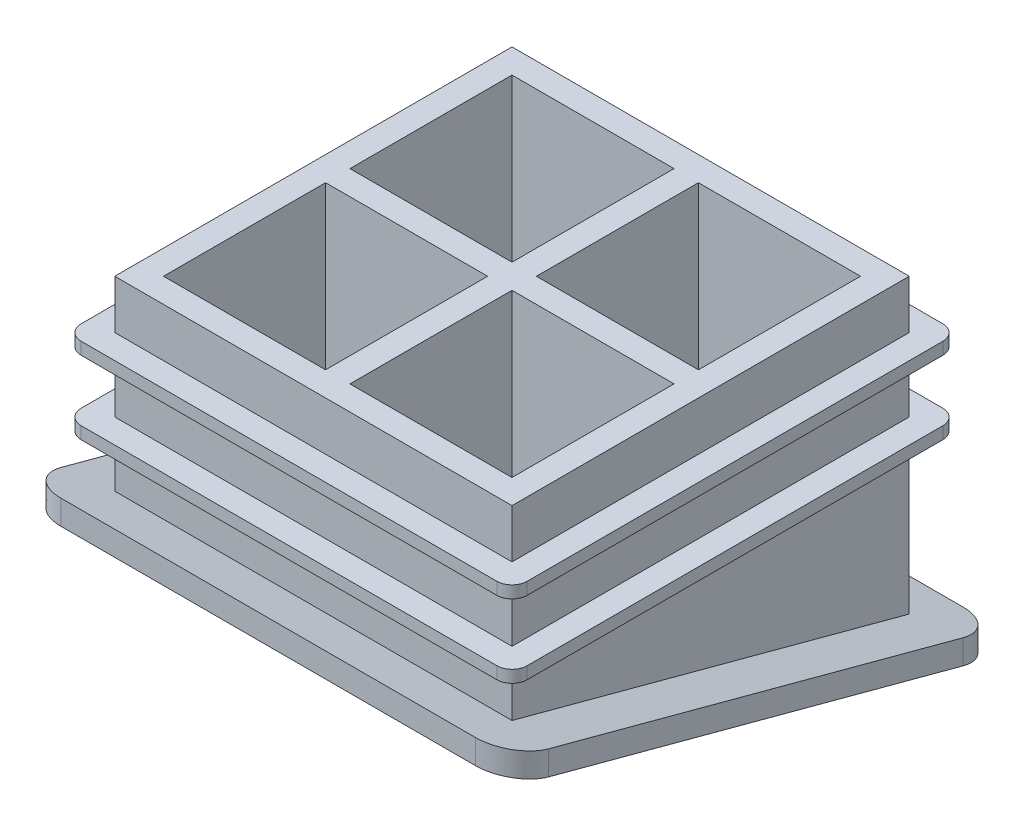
ISO-10303-21;
HEADER;
FILE_DESCRIPTION(('STEP AP214'),'2;1');
FILE_NAME('part.step','',(''),(''),'','','');
FILE_SCHEMA(('AUTOMOTIVE_DESIGN { 1 0 10303 214 1 1 1 1 }'));
ENDSEC;
DATA;
#1=APPLICATION_CONTEXT('core data for automotive mechanical design processes');
#2=APPLICATION_PROTOCOL_DEFINITION('international standard','automotive_design',2000,#1);
#3=PRODUCT_CONTEXT('',#1,'mechanical');
#4=PRODUCT('Part','Part','',(#3));
#5=PRODUCT_RELATED_PRODUCT_CATEGORY('part','',(#4));
#6=PRODUCT_DEFINITION_FORMATION('','',#4);
#7=PRODUCT_DEFINITION_CONTEXT('part definition',#1,'design');
#8=PRODUCT_DEFINITION('design','',#6,#7);
#9=PRODUCT_DEFINITION_SHAPE('','',#8);
#10=(LENGTH_UNIT() NAMED_UNIT(*) SI_UNIT(.MILLI.,.METRE.));
#11=(NAMED_UNIT(*) PLANE_ANGLE_UNIT() SI_UNIT($,.RADIAN.));
#12=(NAMED_UNIT(*) SI_UNIT($,.STERADIAN.) SOLID_ANGLE_UNIT());
#13=UNCERTAINTY_MEASURE_WITH_UNIT(LENGTH_MEASURE(1.E-05),#10,'distance_accuracy_value','');
#14=(GEOMETRIC_REPRESENTATION_CONTEXT(3) GLOBAL_UNCERTAINTY_ASSIGNED_CONTEXT((#13)) GLOBAL_UNIT_ASSIGNED_CONTEXT((#10,
#11,#12)) REPRESENTATION_CONTEXT('',''));
#15=CARTESIAN_POINT('',(0.,0.,0.));
#16=DIRECTION('',(0.,0.,1.));
#17=DIRECTION('',(1.,0.,0.));
#18=AXIS2_PLACEMENT_3D('',#15,#16,#17);
#19=CARTESIAN_POINT('',(-16.3,10.2442859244,18.2321955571));
#20=DIRECTION('',(0.,0.965925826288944,-0.258819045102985));
#21=DIRECTION('',(0.,0.258819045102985,0.965925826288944));
#22=AXIS2_PLACEMENT_3D('',#19,#20,#21);
#23=PLANE('',#22);
#24=DIRECTION('',(-1.,0.,0.));
#25=VECTOR('',#24,1.);
#26=CARTESIAN_POINT('',(1.,5.09103465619,-1.));
#27=LINE('',#26,#25);
#28=CARTESIAN_POINT('',(-0.999999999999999,5.09103465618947,-0.99999999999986));
#29=VERTEX_POINT('',#28);
#30=CARTESIAN_POINT('',(-14.3,5.09103465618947,-0.999999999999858));
#31=VERTEX_POINT('',#30);
#32=EDGE_CURVE('E656',#29,#31,#27,.T.);
#33=ORIENTED_EDGE('',*,*,#32,.F.);
#34=DIRECTION('',(0.,0.258819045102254,0.96592582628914));
#35=VECTOR('',#34,1.);
#36=CARTESIAN_POINT('',(-1.,1.52731039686,-14.3));
#37=LINE('',#36,#35);
#38=CARTESIAN_POINT('',(-0.999999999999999,1.52731039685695,-14.2999999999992));
#39=VERTEX_POINT('',#38);
#40=EDGE_CURVE('E327',#39,#29,#37,.T.);
#41=ORIENTED_EDGE('',*,*,#40,.F.);
#42=DIRECTION('',(1.,0.,0.));
#43=VECTOR('',#42,1.);
#44=CARTESIAN_POINT('',(-14.3,1.52731039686,-14.3));
#45=LINE('',#44,#43);
#46=CARTESIAN_POINT('',(-14.3,1.52731039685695,-14.2999999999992));
#47=VERTEX_POINT('',#46);
#48=EDGE_CURVE('E326',#47,#39,#45,.T.);
#49=ORIENTED_EDGE('',*,*,#48,.F.);
#50=DIRECTION('',(0.,-0.258819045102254,-0.96592582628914));
#51=VECTOR('',#50,1.);
#52=CARTESIAN_POINT('',(-14.3,5.09103465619,-1.));
#53=LINE('',#52,#51);
#54=EDGE_CURVE('E313',#31,#47,#53,.T.);
#55=ORIENTED_EDGE('',*,*,#54,.F.);
#56=EDGE_LOOP('',(#33,#41,#49,#55));
#57=FACE_BOUND('',#56,.T.);
#58=ADVANCED_FACE('F16',(#57),#23,.T.);
#59=CARTESIAN_POINT('',(-16.3,10.2442859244,18.2321955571));
#60=DIRECTION('',(0.,0.965925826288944,-0.258819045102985));
#61=DIRECTION('',(0.,0.258819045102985,0.965925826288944));
#62=AXIS2_PLACEMENT_3D('',#59,#60,#61);
#63=PLANE('',#62);
#64=DIRECTION('',(0.,0.258819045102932,0.965925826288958));
#65=VECTOR('',#64,1.);
#66=CARTESIAN_POINT('',(-1.,5.62693304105,1.));
#67=LINE('',#66,#65);
#68=CARTESIAN_POINT('',(-0.999999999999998,5.62693304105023,0.999999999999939));
#69=VERTEX_POINT('',#68);
#70=CARTESIAN_POINT('',(-0.999999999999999,9.19065730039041,14.2999999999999));
#71=VERTEX_POINT('',#70);
#72=EDGE_CURVE('E635',#69,#71,#67,.T.);
#73=ORIENTED_EDGE('',*,*,#72,.F.);
#74=DIRECTION('',(1.,0.,0.));
#75=VECTOR('',#74,1.);
#76=CARTESIAN_POINT('',(14.3,5.62693304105,1.));
#77=LINE('',#76,#75);
#78=CARTESIAN_POINT('',(-14.3,5.62693304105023,0.999999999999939));
#79=VERTEX_POINT('',#78);
#80=EDGE_CURVE('E644',#79,#69,#77,.T.);
#81=ORIENTED_EDGE('',*,*,#80,.F.);
#82=DIRECTION('',(0.,-0.258819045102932,-0.965925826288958));
#83=VECTOR('',#82,1.);
#84=CARTESIAN_POINT('',(-14.3,9.19065730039,14.3));
#85=LINE('',#84,#83);
#86=CARTESIAN_POINT('',(-14.3,9.19065730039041,14.2999999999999));
#87=VERTEX_POINT('',#86);
#88=EDGE_CURVE('E649',#87,#79,#85,.T.);
#89=ORIENTED_EDGE('',*,*,#88,.F.);
#90=DIRECTION('',(-1.,0.,0.));
#91=VECTOR('',#90,1.);
#92=CARTESIAN_POINT('',(14.3,9.19065730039,14.3));
#93=LINE('',#92,#91);
#94=EDGE_CURVE('E654',#71,#87,#93,.T.);
#95=ORIENTED_EDGE('',*,*,#94,.F.);
#96=EDGE_LOOP('',(#73,#81,#89,#95));
#97=FACE_BOUND('',#96,.T.);
#98=ADVANCED_FACE('F939',(#97),#63,.T.);
#99=CARTESIAN_POINT('',(-16.3,10.2442859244,18.2321955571));
#100=DIRECTION('',(0.,0.965925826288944,-0.258819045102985));
#101=DIRECTION('',(0.,0.258819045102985,0.965925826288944));
#102=AXIS2_PLACEMENT_3D('',#99,#100,#101);
#103=PLANE('',#102);
#104=DIRECTION('',(1.,0.,0.));
#105=VECTOR('',#104,1.);
#106=CARTESIAN_POINT('',(14.3,5.62693304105,1.));
#107=LINE('',#106,#105);
#108=CARTESIAN_POINT('',(1.,5.62693304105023,0.999999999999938));
#109=VERTEX_POINT('',#108);
#110=CARTESIAN_POINT('',(14.3,5.62693304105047,0.999999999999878));
#111=VERTEX_POINT('',#110);
#112=EDGE_CURVE('E627',#109,#111,#107,.T.);
#113=ORIENTED_EDGE('',*,*,#112,.F.);
#114=DIRECTION('',(0.,-0.258819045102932,-0.965925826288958));
#115=VECTOR('',#114,1.);
#116=CARTESIAN_POINT('',(1.,9.19065730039,14.3));
#117=LINE('',#116,#115);
#118=CARTESIAN_POINT('',(1.,9.19065730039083,14.2999999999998));
#119=VERTEX_POINT('',#118);
#120=EDGE_CURVE('E633',#119,#109,#117,.T.);
#121=ORIENTED_EDGE('',*,*,#120,.F.);
#122=DIRECTION('',(-1.,0.,0.));
#123=VECTOR('',#122,1.);
#124=CARTESIAN_POINT('',(14.3,9.19065730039,14.3));
#125=LINE('',#124,#123);
#126=CARTESIAN_POINT('',(14.3,9.19065730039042,14.2999999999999));
#127=VERTEX_POINT('',#126);
#128=EDGE_CURVE('E616',#127,#119,#125,.T.);
#129=ORIENTED_EDGE('',*,*,#128,.F.);
#130=DIRECTION('',(0.,0.258819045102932,0.965925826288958));
#131=VECTOR('',#130,1.);
#132=CARTESIAN_POINT('',(14.3,5.62693304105,1.));
#133=LINE('',#132,#131);
#134=EDGE_CURVE('E625',#111,#127,#133,.T.);
#135=ORIENTED_EDGE('',*,*,#134,.F.);
#136=EDGE_LOOP('',(#113,#121,#129,#135));
#137=FACE_BOUND('',#136,.T.);
#138=ADVANCED_FACE('F944',(#137),#103,.T.);
#139=CARTESIAN_POINT('',(-16.3,10.2442859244,18.2321955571));
#140=DIRECTION('',(0.,0.965925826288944,-0.258819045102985));
#141=DIRECTION('',(0.,0.258819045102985,0.965925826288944));
#142=AXIS2_PLACEMENT_3D('',#139,#140,#141);
#143=PLANE('',#142);
#144=DIRECTION('',(0.,-0.258819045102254,-0.96592582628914));
#145=VECTOR('',#144,1.);
#146=CARTESIAN_POINT('',(1.,5.09103465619,-1.));
#147=LINE('',#146,#145);
#148=CARTESIAN_POINT('',(1.,5.09103465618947,-0.999999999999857));
#149=VERTEX_POINT('',#148);
#150=CARTESIAN_POINT('',(1.,1.52731039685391,-14.2999999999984));
#151=VERTEX_POINT('',#150);
#152=EDGE_CURVE('E600',#149,#151,#147,.T.);
#153=ORIENTED_EDGE('',*,*,#152,.F.);
#154=DIRECTION('',(-1.,0.,0.));
#155=VECTOR('',#154,1.);
#156=CARTESIAN_POINT('',(1.,5.09103465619,-1.));
#157=LINE('',#156,#155);
#158=CARTESIAN_POINT('',(14.3,5.09103465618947,-0.999999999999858));
#159=VERTEX_POINT('',#158);
#160=EDGE_CURVE('E606',#159,#149,#157,.T.);
#161=ORIENTED_EDGE('',*,*,#160,.F.);
#162=DIRECTION('',(0.,0.258819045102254,0.96592582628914));
#163=VECTOR('',#162,1.);
#164=CARTESIAN_POINT('',(14.3,1.52731039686,-14.3));
#165=LINE('',#164,#163);
#166=CARTESIAN_POINT('',(14.3,1.52731039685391,-14.2999999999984));
#167=VERTEX_POINT('',#166);
#168=EDGE_CURVE('E611',#167,#159,#165,.T.);
#169=ORIENTED_EDGE('',*,*,#168,.F.);
#170=DIRECTION('',(1.,0.,0.));
#171=VECTOR('',#170,1.);
#172=CARTESIAN_POINT('',(-14.3,1.52731039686,-14.3));
#173=LINE('',#172,#171);
#174=EDGE_CURVE('E597',#151,#167,#173,.T.);
#175=ORIENTED_EDGE('',*,*,#174,.F.);
#176=EDGE_LOOP('',(#153,#161,#169,#175));
#177=FACE_BOUND('',#176,.T.);
#178=ADVANCED_FACE('F949',(#177),#143,.T.);
#179=CARTESIAN_POINT('',(-14.3,0.,14.3));
#180=DIRECTION('',(1.,0.,0.));
#181=DIRECTION('',(0.,0.,-1.));
#182=AXIS2_PLACEMENT_3D('',#179,#180,#181);
#183=PLANE('',#182);
#184=DIRECTION('',(0.,0.,1.));
#185=VECTOR('',#184,1.);
#186=CARTESIAN_POINT('',(-14.3,25.,0.));
#187=LINE('',#186,#185);
#188=CARTESIAN_POINT('',(-14.3,25.,-1.));
#189=VERTEX_POINT('',#188);
#190=CARTESIAN_POINT('',(-14.3,25.,-14.3));
#191=VERTEX_POINT('',#190);
#192=EDGE_CURVE('E589',#189,#191,#187,.F.);
#193=ORIENTED_EDGE('',*,*,#192,.F.);
#194=DIRECTION('',(0.,1.,0.));
#195=VECTOR('',#194,1.);
#196=CARTESIAN_POINT('',(-14.3,25.,-1.));
#197=LINE('',#196,#195);
#198=EDGE_CURVE('E320',#31,#189,#197,.T.);
#199=ORIENTED_EDGE('',*,*,#198,.F.);
#200=ORIENTED_EDGE('',*,*,#54,.T.);
#201=DIRECTION('',(0.,1.,0.));
#202=VECTOR('',#201,1.);
#203=CARTESIAN_POINT('',(-14.3,0.,-14.3));
#204=LINE('',#203,#202);
#205=EDGE_CURVE('E317',#191,#47,#204,.F.);
#206=ORIENTED_EDGE('',*,*,#205,.F.);
#207=EDGE_LOOP('',(#193,#199,#200,#206));
#208=FACE_BOUND('',#207,.T.);
#209=ADVANCED_FACE('F315',(#208),#183,.T.);
#210=CARTESIAN_POINT('',(-14.3,0.,-14.3));
#211=DIRECTION('',(0.,0.,1.));
#212=DIRECTION('',(1.,0.,0.));
#213=AXIS2_PLACEMENT_3D('',#210,#211,#212);
#214=PLANE('',#213);
#215=ORIENTED_EDGE('',*,*,#48,.T.);
#216=DIRECTION('',(0.,1.,0.));
#217=VECTOR('',#216,1.);
#218=CARTESIAN_POINT('',(-1.,25.,-14.3));
#219=LINE('',#218,#217);
#220=CARTESIAN_POINT('',(-1.,25.,-14.3));
#221=VERTEX_POINT('',#220);
#222=EDGE_CURVE('E330',#221,#39,#219,.F.);
#223=ORIENTED_EDGE('',*,*,#222,.F.);
#224=DIRECTION('',(1.,0.,0.));
#225=VECTOR('',#224,1.);
#226=CARTESIAN_POINT('',(0.,25.,-14.3));
#227=LINE('',#226,#225);
#228=EDGE_CURVE('E334',#191,#221,#227,.T.);
#229=ORIENTED_EDGE('',*,*,#228,.F.);
#230=ORIENTED_EDGE('',*,*,#205,.T.);
#231=EDGE_LOOP('',(#215,#223,#229,#230));
#232=FACE_BOUND('',#231,.T.);
#233=ADVANCED_FACE('F332',(#232),#214,.T.);
#234=CARTESIAN_POINT('',(-1.,25.,-1.));
#235=DIRECTION('',(-1.,0.,0.));
#236=DIRECTION('',(0.,0.,1.));
#237=AXIS2_PLACEMENT_3D('',#234,#235,#236);
#238=PLANE('',#237);
#239=ORIENTED_EDGE('',*,*,#222,.T.);
#240=ORIENTED_EDGE('',*,*,#40,.T.);
#241=DIRECTION('',(0.,1.,0.));
#242=VECTOR('',#241,1.);
#243=CARTESIAN_POINT('',(-1.,25.,-1.));
#244=LINE('',#243,#242);
#245=CARTESIAN_POINT('',(-1.,25.,-1.));
#246=VERTEX_POINT('',#245);
#247=EDGE_CURVE('E658',#246,#29,#244,.F.);
#248=ORIENTED_EDGE('',*,*,#247,.F.);
#249=DIRECTION('',(0.,0.,1.));
#250=VECTOR('',#249,1.);
#251=CARTESIAN_POINT('',(-1.,25.,0.));
#252=LINE('',#251,#250);
#253=EDGE_CURVE('E585',#221,#246,#252,.T.);
#254=ORIENTED_EDGE('',*,*,#253,.F.);
#255=EDGE_LOOP('',(#239,#240,#248,#254));
#256=FACE_BOUND('',#255,.T.);
#257=ADVANCED_FACE('F664',(#256),#238,.T.);
#258=CARTESIAN_POINT('',(1.,25.,-1.));
#259=DIRECTION('',(0.,0.,-1.));
#260=DIRECTION('',(-1.,0.,0.));
#261=AXIS2_PLACEMENT_3D('',#258,#259,#260);
#262=PLANE('',#261);
#263=ORIENTED_EDGE('',*,*,#247,.T.);
#264=ORIENTED_EDGE('',*,*,#32,.T.);
#265=ORIENTED_EDGE('',*,*,#198,.T.);
#266=DIRECTION('',(1.,0.,0.));
#267=VECTOR('',#266,1.);
#268=CARTESIAN_POINT('',(0.,25.,-1.));
#269=LINE('',#268,#267);
#270=EDGE_CURVE('E582',#246,#189,#269,.F.);
#271=ORIENTED_EDGE('',*,*,#270,.F.);
#272=EDGE_LOOP('',(#263,#264,#265,#271));
#273=FACE_BOUND('',#272,.T.);
#274=ADVANCED_FACE('F670',(#273),#262,.T.);
#275=CARTESIAN_POINT('',(14.3,0.,14.3));
#276=DIRECTION('',(0.,0.,-1.));
#277=DIRECTION('',(-1.,0.,0.));
#278=AXIS2_PLACEMENT_3D('',#275,#276,#277);
#279=PLANE('',#278);
#280=DIRECTION('',(1.,0.,0.));
#281=VECTOR('',#280,1.);
#282=CARTESIAN_POINT('',(0.,25.,14.3));
#283=LINE('',#282,#281);
#284=CARTESIAN_POINT('',(-1.,25.,14.3));
#285=VERTEX_POINT('',#284);
#286=CARTESIAN_POINT('',(-14.3,25.,14.3));
#287=VERTEX_POINT('',#286);
#288=EDGE_CURVE('E579',#285,#287,#283,.F.);
#289=ORIENTED_EDGE('',*,*,#288,.F.);
#290=DIRECTION('',(0.,1.,0.));
#291=VECTOR('',#290,1.);
#292=CARTESIAN_POINT('',(-1.,25.,14.3));
#293=LINE('',#292,#291);
#294=EDGE_CURVE('E641',#71,#285,#293,.T.);
#295=ORIENTED_EDGE('',*,*,#294,.F.);
#296=ORIENTED_EDGE('',*,*,#94,.T.);
#297=DIRECTION('',(0.,1.,0.));
#298=VECTOR('',#297,1.);
#299=CARTESIAN_POINT('',(-14.3,0.,14.3));
#300=LINE('',#299,#298);
#301=EDGE_CURVE('E651',#287,#87,#300,.F.);
#302=ORIENTED_EDGE('',*,*,#301,.F.);
#303=EDGE_LOOP('',(#289,#295,#296,#302));
#304=FACE_BOUND('',#303,.T.);
#305=ADVANCED_FACE('F672',(#304),#279,.T.);
#306=CARTESIAN_POINT('',(-14.3,0.,14.3));
#307=DIRECTION('',(1.,0.,0.));
#308=DIRECTION('',(0.,0.,-1.));
#309=AXIS2_PLACEMENT_3D('',#306,#307,#308);
#310=PLANE('',#309);
#311=ORIENTED_EDGE('',*,*,#88,.T.);
#312=DIRECTION('',(0.,1.,0.));
#313=VECTOR('',#312,1.);
#314=CARTESIAN_POINT('',(-14.3,25.,1.));
#315=LINE('',#314,#313);
#316=CARTESIAN_POINT('',(-14.3,25.,1.));
#317=VERTEX_POINT('',#316);
#318=EDGE_CURVE('E646',#317,#79,#315,.F.);
#319=ORIENTED_EDGE('',*,*,#318,.F.);
#320=DIRECTION('',(0.,0.,1.));
#321=VECTOR('',#320,1.);
#322=CARTESIAN_POINT('',(-14.3,25.,0.));
#323=LINE('',#322,#321);
#324=EDGE_CURVE('E576',#287,#317,#323,.F.);
#325=ORIENTED_EDGE('',*,*,#324,.F.);
#326=ORIENTED_EDGE('',*,*,#301,.T.);
#327=EDGE_LOOP('',(#311,#319,#325,#326));
#328=FACE_BOUND('',#327,.T.);
#329=ADVANCED_FACE('F679',(#328),#310,.T.);
#330=CARTESIAN_POINT('',(14.3,25.,1.));
#331=DIRECTION('',(0.,0.,1.));
#332=DIRECTION('',(1.,0.,0.));
#333=AXIS2_PLACEMENT_3D('',#330,#331,#332);
#334=PLANE('',#333);
#335=ORIENTED_EDGE('',*,*,#318,.T.);
#336=ORIENTED_EDGE('',*,*,#80,.T.);
#337=DIRECTION('',(0.,1.,0.));
#338=VECTOR('',#337,1.);
#339=CARTESIAN_POINT('',(-1.,25.,1.));
#340=LINE('',#339,#338);
#341=CARTESIAN_POINT('',(-1.,25.,1.));
#342=VERTEX_POINT('',#341);
#343=EDGE_CURVE('E638',#342,#69,#340,.F.);
#344=ORIENTED_EDGE('',*,*,#343,.F.);
#345=DIRECTION('',(1.,0.,0.));
#346=VECTOR('',#345,1.);
#347=CARTESIAN_POINT('',(0.,25.,1.));
#348=LINE('',#347,#346);
#349=EDGE_CURVE('E573',#317,#342,#348,.T.);
#350=ORIENTED_EDGE('',*,*,#349,.F.);
#351=EDGE_LOOP('',(#335,#336,#344,#350));
#352=FACE_BOUND('',#351,.T.);
#353=ADVANCED_FACE('F924',(#352),#334,.T.);
#354=CARTESIAN_POINT('',(-1.,25.,-1.));
#355=DIRECTION('',(-1.,0.,0.));
#356=DIRECTION('',(0.,0.,1.));
#357=AXIS2_PLACEMENT_3D('',#354,#355,#356);
#358=PLANE('',#357);
#359=ORIENTED_EDGE('',*,*,#343,.T.);
#360=ORIENTED_EDGE('',*,*,#72,.T.);
#361=ORIENTED_EDGE('',*,*,#294,.T.);
#362=DIRECTION('',(0.,0.,1.));
#363=VECTOR('',#362,1.);
#364=CARTESIAN_POINT('',(-1.,25.,0.));
#365=LINE('',#364,#363);
#366=EDGE_CURVE('E570',#342,#285,#365,.T.);
#367=ORIENTED_EDGE('',*,*,#366,.F.);
#368=EDGE_LOOP('',(#359,#360,#361,#367));
#369=FACE_BOUND('',#368,.T.);
#370=ADVANCED_FACE('F920',(#369),#358,.T.);
#371=CARTESIAN_POINT('',(1.,25.,1.));
#372=DIRECTION('',(1.,0.,0.));
#373=DIRECTION('',(0.,0.,-1.));
#374=AXIS2_PLACEMENT_3D('',#371,#372,#373);
#375=PLANE('',#374);
#376=DIRECTION('',(0.,1.,0.));
#377=VECTOR('',#376,1.);
#378=CARTESIAN_POINT('',(1.,0.,14.3));
#379=LINE('',#378,#377);
#380=CARTESIAN_POINT('',(1.,25.,14.3));
#381=VERTEX_POINT('',#380);
#382=EDGE_CURVE('E613',#119,#381,#379,.T.);
#383=ORIENTED_EDGE('',*,*,#382,.F.);
#384=ORIENTED_EDGE('',*,*,#120,.T.);
#385=DIRECTION('',(0.,1.,0.));
#386=VECTOR('',#385,1.);
#387=CARTESIAN_POINT('',(1.,25.,1.));
#388=LINE('',#387,#386);
#389=CARTESIAN_POINT('',(1.,25.,1.));
#390=VERTEX_POINT('',#389);
#391=EDGE_CURVE('E630',#390,#109,#388,.F.);
#392=ORIENTED_EDGE('',*,*,#391,.F.);
#393=DIRECTION('',(0.,0.,1.));
#394=VECTOR('',#393,1.);
#395=CARTESIAN_POINT('',(1.,25.,0.));
#396=LINE('',#395,#394);
#397=EDGE_CURVE('E567',#381,#390,#396,.F.);
#398=ORIENTED_EDGE('',*,*,#397,.F.);
#399=EDGE_LOOP('',(#383,#384,#392,#398));
#400=FACE_BOUND('',#399,.T.);
#401=ADVANCED_FACE('F916',(#400),#375,.T.);
#402=CARTESIAN_POINT('',(14.3,25.,1.));
#403=DIRECTION('',(0.,0.,1.));
#404=DIRECTION('',(1.,0.,0.));
#405=AXIS2_PLACEMENT_3D('',#402,#403,#404);
#406=PLANE('',#405);
#407=ORIENTED_EDGE('',*,*,#391,.T.);
#408=ORIENTED_EDGE('',*,*,#112,.T.);
#409=DIRECTION('',(0.,1.,0.));
#410=VECTOR('',#409,1.);
#411=CARTESIAN_POINT('',(14.3,0.,1.));
#412=LINE('',#411,#410);
#413=CARTESIAN_POINT('',(14.3,25.,1.));
#414=VERTEX_POINT('',#413);
#415=EDGE_CURVE('E622',#414,#111,#412,.F.);
#416=ORIENTED_EDGE('',*,*,#415,.F.);
#417=DIRECTION('',(1.,0.,0.));
#418=VECTOR('',#417,1.);
#419=CARTESIAN_POINT('',(0.,25.,1.));
#420=LINE('',#419,#418);
#421=EDGE_CURVE('E564',#390,#414,#420,.T.);
#422=ORIENTED_EDGE('',*,*,#421,.F.);
#423=EDGE_LOOP('',(#407,#408,#416,#422));
#424=FACE_BOUND('',#423,.T.);
#425=ADVANCED_FACE('F912',(#424),#406,.T.);
#426=CARTESIAN_POINT('',(14.3,0.,-14.3));
#427=DIRECTION('',(-1.,0.,0.));
#428=DIRECTION('',(0.,0.,1.));
#429=AXIS2_PLACEMENT_3D('',#426,#427,#428);
#430=PLANE('',#429);
#431=DIRECTION('',(0.,0.,1.));
#432=VECTOR('',#431,1.);
#433=CARTESIAN_POINT('',(14.3,25.,0.));
#434=LINE('',#433,#432);
#435=CARTESIAN_POINT('',(14.3,25.,14.3));
#436=VERTEX_POINT('',#435);
#437=EDGE_CURVE('E561',#414,#436,#434,.T.);
#438=ORIENTED_EDGE('',*,*,#437,.F.);
#439=ORIENTED_EDGE('',*,*,#415,.T.);
#440=ORIENTED_EDGE('',*,*,#134,.T.);
#441=DIRECTION('',(0.,1.,0.));
#442=VECTOR('',#441,1.);
#443=CARTESIAN_POINT('',(14.3,0.,14.3));
#444=LINE('',#443,#442);
#445=EDGE_CURVE('E619',#436,#127,#444,.F.);
#446=ORIENTED_EDGE('',*,*,#445,.F.);
#447=EDGE_LOOP('',(#438,#439,#440,#446));
#448=FACE_BOUND('',#447,.T.);
#449=ADVANCED_FACE('F908',(#448),#430,.T.);
#450=CARTESIAN_POINT('',(14.3,0.,14.3));
#451=DIRECTION('',(0.,0.,-1.));
#452=DIRECTION('',(-1.,0.,0.));
#453=AXIS2_PLACEMENT_3D('',#450,#451,#452);
#454=PLANE('',#453);
#455=ORIENTED_EDGE('',*,*,#128,.T.);
#456=ORIENTED_EDGE('',*,*,#382,.T.);
#457=DIRECTION('',(1.,0.,0.));
#458=VECTOR('',#457,1.);
#459=CARTESIAN_POINT('',(0.,25.,14.3));
#460=LINE('',#459,#458);
#461=EDGE_CURVE('E558',#436,#381,#460,.F.);
#462=ORIENTED_EDGE('',*,*,#461,.F.);
#463=ORIENTED_EDGE('',*,*,#445,.T.);
#464=EDGE_LOOP('',(#455,#456,#462,#463));
#465=FACE_BOUND('',#464,.T.);
#466=ADVANCED_FACE('F904',(#465),#454,.T.);
#467=CARTESIAN_POINT('',(14.3,0.,-14.3));
#468=DIRECTION('',(-1.,0.,0.));
#469=DIRECTION('',(0.,0.,1.));
#470=AXIS2_PLACEMENT_3D('',#467,#468,#469);
#471=PLANE('',#470);
#472=ORIENTED_EDGE('',*,*,#168,.T.);
#473=DIRECTION('',(0.,1.,0.));
#474=VECTOR('',#473,1.);
#475=CARTESIAN_POINT('',(14.3,25.,-1.));
#476=LINE('',#475,#474);
#477=CARTESIAN_POINT('',(14.3,25.,-1.));
#478=VERTEX_POINT('',#477);
#479=EDGE_CURVE('E608',#478,#159,#476,.F.);
#480=ORIENTED_EDGE('',*,*,#479,.F.);
#481=DIRECTION('',(0.,0.,1.));
#482=VECTOR('',#481,1.);
#483=CARTESIAN_POINT('',(14.3,25.,0.));
#484=LINE('',#483,#482);
#485=CARTESIAN_POINT('',(14.3,25.,-14.3));
#486=VERTEX_POINT('',#485);
#487=EDGE_CURVE('E555',#486,#478,#484,.T.);
#488=ORIENTED_EDGE('',*,*,#487,.F.);
#489=DIRECTION('',(0.,1.,0.));
#490=VECTOR('',#489,1.);
#491=CARTESIAN_POINT('',(14.3,0.,-14.3));
#492=LINE('',#491,#490);
#493=EDGE_CURVE('E594',#167,#486,#492,.T.);
#494=ORIENTED_EDGE('',*,*,#493,.F.);
#495=EDGE_LOOP('',(#472,#480,#488,#494));
#496=FACE_BOUND('',#495,.T.);
#497=ADVANCED_FACE('F900',(#496),#471,.T.);
#498=CARTESIAN_POINT('',(1.,25.,-1.));
#499=DIRECTION('',(0.,0.,-1.));
#500=DIRECTION('',(-1.,0.,0.));
#501=AXIS2_PLACEMENT_3D('',#498,#499,#500);
#502=PLANE('',#501);
#503=ORIENTED_EDGE('',*,*,#479,.T.);
#504=ORIENTED_EDGE('',*,*,#160,.T.);
#505=DIRECTION('',(0.,1.,0.));
#506=VECTOR('',#505,1.);
#507=CARTESIAN_POINT('',(1.,25.,-1.));
#508=LINE('',#507,#506);
#509=CARTESIAN_POINT('',(1.,25.,-1.));
#510=VERTEX_POINT('',#509);
#511=EDGE_CURVE('E603',#510,#149,#508,.F.);
#512=ORIENTED_EDGE('',*,*,#511,.F.);
#513=DIRECTION('',(1.,0.,0.));
#514=VECTOR('',#513,1.);
#515=CARTESIAN_POINT('',(0.,25.,-1.));
#516=LINE('',#515,#514);
#517=EDGE_CURVE('E552',#478,#510,#516,.F.);
#518=ORIENTED_EDGE('',*,*,#517,.F.);
#519=EDGE_LOOP('',(#503,#504,#512,#518));
#520=FACE_BOUND('',#519,.T.);
#521=ADVANCED_FACE('F896',(#520),#502,.T.);
#522=CARTESIAN_POINT('',(1.,25.,1.));
#523=DIRECTION('',(1.,0.,0.));
#524=DIRECTION('',(0.,0.,-1.));
#525=AXIS2_PLACEMENT_3D('',#522,#523,#524);
#526=PLANE('',#525);
#527=ORIENTED_EDGE('',*,*,#511,.T.);
#528=ORIENTED_EDGE('',*,*,#152,.T.);
#529=DIRECTION('',(0.,1.,0.));
#530=VECTOR('',#529,1.);
#531=CARTESIAN_POINT('',(1.,0.,-14.3));
#532=LINE('',#531,#530);
#533=CARTESIAN_POINT('',(1.,25.,-14.3));
#534=VERTEX_POINT('',#533);
#535=EDGE_CURVE('E591',#534,#151,#532,.F.);
#536=ORIENTED_EDGE('',*,*,#535,.F.);
#537=DIRECTION('',(0.,0.,1.));
#538=VECTOR('',#537,1.);
#539=CARTESIAN_POINT('',(1.,25.,0.));
#540=LINE('',#539,#538);
#541=EDGE_CURVE('E549',#510,#534,#540,.F.);
#542=ORIENTED_EDGE('',*,*,#541,.F.);
#543=EDGE_LOOP('',(#527,#528,#536,#542));
#544=FACE_BOUND('',#543,.T.);
#545=ADVANCED_FACE('F892',(#544),#526,.T.);
#546=CARTESIAN_POINT('',(-14.3,0.,-14.3));
#547=DIRECTION('',(0.,0.,1.));
#548=DIRECTION('',(1.,0.,0.));
#549=AXIS2_PLACEMENT_3D('',#546,#547,#548);
#550=PLANE('',#549);
#551=DIRECTION('',(1.,0.,0.));
#552=VECTOR('',#551,1.);
#553=CARTESIAN_POINT('',(0.,25.,-14.3));
#554=LINE('',#553,#552);
#555=EDGE_CURVE('E546',#534,#486,#554,.T.);
#556=ORIENTED_EDGE('',*,*,#555,.F.);
#557=ORIENTED_EDGE('',*,*,#535,.T.);
#558=ORIENTED_EDGE('',*,*,#174,.T.);
#559=ORIENTED_EDGE('',*,*,#493,.T.);
#560=EDGE_LOOP('',(#556,#557,#558,#559));
#561=FACE_BOUND('',#560,.T.);
#562=ADVANCED_FACE('F888',(#561),#550,.T.);
#563=CARTESIAN_POINT('',(0.,25.,0.));
#564=DIRECTION('',(0.,1.,0.));
#565=DIRECTION('',(0.,0.,1.));
#566=AXIS2_PLACEMENT_3D('',#563,#564,#565);
#567=PLANE('',#566);
#568=ORIENTED_EDGE('',*,*,#541,.T.);
#569=ORIENTED_EDGE('',*,*,#555,.T.);
#570=ORIENTED_EDGE('',*,*,#487,.T.);
#571=ORIENTED_EDGE('',*,*,#517,.T.);
#572=EDGE_LOOP('',(#568,#569,#570,#571));
#573=FACE_BOUND('',#572,.T.);
#574=ORIENTED_EDGE('',*,*,#437,.T.);
#575=ORIENTED_EDGE('',*,*,#461,.T.);
#576=ORIENTED_EDGE('',*,*,#397,.T.);
#577=ORIENTED_EDGE('',*,*,#421,.T.);
#578=EDGE_LOOP('',(#574,#575,#576,#577));
#579=FACE_BOUND('',#578,.T.);
#580=ORIENTED_EDGE('',*,*,#349,.T.);
#581=ORIENTED_EDGE('',*,*,#366,.T.);
#582=ORIENTED_EDGE('',*,*,#288,.T.);
#583=ORIENTED_EDGE('',*,*,#324,.T.);
#584=EDGE_LOOP('',(#580,#581,#582,#583));
#585=FACE_BOUND('',#584,.T.);
#586=ORIENTED_EDGE('',*,*,#253,.T.);
#587=ORIENTED_EDGE('',*,*,#270,.T.);
#588=ORIENTED_EDGE('',*,*,#192,.T.);
#589=ORIENTED_EDGE('',*,*,#228,.T.);
#590=EDGE_LOOP('',(#586,#587,#588,#589));
#591=FACE_BOUND('',#590,.T.);
#592=DIRECTION('',(0.,0.,-1.));
#593=VECTOR('',#592,1.);
#594=CARTESIAN_POINT('',(-16.3,25.,16.3));
#595=LINE('',#594,#593);
#596=CARTESIAN_POINT('',(-16.3,25.,-16.3));
#597=VERTEX_POINT('',#596);
#598=CARTESIAN_POINT('',(-16.3,25.,16.3));
#599=VERTEX_POINT('',#598);
#600=EDGE_CURVE('E534',#597,#599,#595,.F.);
#601=ORIENTED_EDGE('',*,*,#600,.T.);
#602=DIRECTION('',(-1.,0.,0.));
#603=VECTOR('',#602,1.);
#604=CARTESIAN_POINT('',(16.3,25.,16.3));
#605=LINE('',#604,#603);
#606=CARTESIAN_POINT('',(16.3,25.,16.3));
#607=VERTEX_POINT('',#606);
#608=EDGE_CURVE('E530',#599,#607,#605,.F.);
#609=ORIENTED_EDGE('',*,*,#608,.T.);
#610=DIRECTION('',(0.,0.,1.));
#611=VECTOR('',#610,1.);
#612=CARTESIAN_POINT('',(16.3,25.,-16.3));
#613=LINE('',#612,#611);
#614=CARTESIAN_POINT('',(16.3,25.,-16.3));
#615=VERTEX_POINT('',#614);
#616=EDGE_CURVE('E544',#607,#615,#613,.F.);
#617=ORIENTED_EDGE('',*,*,#616,.T.);
#618=DIRECTION('',(1.,0.,0.));
#619=VECTOR('',#618,1.);
#620=CARTESIAN_POINT('',(-16.3,25.,-16.3));
#621=LINE('',#620,#619);
#622=EDGE_CURVE('E539',#615,#597,#621,.F.);
#623=ORIENTED_EDGE('',*,*,#622,.T.);
#624=EDGE_LOOP('',(#601,#609,#617,#623));
#625=FACE_BOUND('',#624,.T.);
#626=ADVANCED_FACE('F667',(#573,#579,#585,#591,#625),#567,.T.);
#627=CARTESIAN_POINT('',(16.3,0.,-16.3));
#628=DIRECTION('',(-1.,0.,0.));
#629=DIRECTION('',(0.,0.,1.));
#630=AXIS2_PLACEMENT_3D('',#627,#628,#629);
#631=PLANE('',#630);
#632=DIRECTION('',(0.,1.,0.));
#633=VECTOR('',#632,1.);
#634=CARTESIAN_POINT('',(16.3,0.,-16.3));
#635=LINE('',#634,#633);
#636=CARTESIAN_POINT('',(16.3,21.,-16.3));
#637=VERTEX_POINT('',#636);
#638=EDGE_CURVE('E541',#637,#615,#635,.T.);
#639=ORIENTED_EDGE('',*,*,#638,.T.);
#640=ORIENTED_EDGE('',*,*,#616,.F.);
#641=DIRECTION('',(0.,1.,0.));
#642=VECTOR('',#641,1.);
#643=CARTESIAN_POINT('',(16.3,0.,16.3));
#644=LINE('',#643,#642);
#645=CARTESIAN_POINT('',(16.3,21.,16.3));
#646=VERTEX_POINT('',#645);
#647=EDGE_CURVE('E526',#607,#646,#644,.F.);
#648=ORIENTED_EDGE('',*,*,#647,.T.);
#649=DIRECTION('',(0.,0.,-1.));
#650=VECTOR('',#649,1.);
#651=CARTESIAN_POINT('',(16.3,21.,20.3));
#652=LINE('',#651,#650);
#653=EDGE_CURVE('E524',#646,#637,#652,.T.);
#654=ORIENTED_EDGE('',*,*,#653,.T.);
#655=EDGE_LOOP('',(#639,#640,#648,#654));
#656=FACE_BOUND('',#655,.T.);
#657=ADVANCED_FACE('F881',(#656),#631,.F.);
#658=CARTESIAN_POINT('',(-16.3,0.,-16.3));
#659=DIRECTION('',(0.,0.,1.));
#660=DIRECTION('',(1.,0.,0.));
#661=AXIS2_PLACEMENT_3D('',#658,#659,#660);
#662=PLANE('',#661);
#663=DIRECTION('',(0.,1.,0.));
#664=VECTOR('',#663,1.);
#665=CARTESIAN_POINT('',(-16.3,0.,-16.3));
#666=LINE('',#665,#664);
#667=CARTESIAN_POINT('',(-16.3,21.,-16.3));
#668=VERTEX_POINT('',#667);
#669=EDGE_CURVE('E536',#668,#597,#666,.T.);
#670=ORIENTED_EDGE('',*,*,#669,.T.);
#671=ORIENTED_EDGE('',*,*,#622,.F.);
#672=ORIENTED_EDGE('',*,*,#638,.F.);
#673=DIRECTION('',(1.,0.,0.));
#674=VECTOR('',#673,1.);
#675=CARTESIAN_POINT('',(-16.3,21.,-16.3));
#676=LINE('',#675,#674);
#677=EDGE_CURVE('E522',#637,#668,#676,.F.);
#678=ORIENTED_EDGE('',*,*,#677,.T.);
#679=EDGE_LOOP('',(#670,#671,#672,#678));
#680=FACE_BOUND('',#679,.T.);
#681=ADVANCED_FACE('F878',(#680),#662,.F.);
#682=CARTESIAN_POINT('',(-16.3,0.,16.3));
#683=DIRECTION('',(1.,0.,0.));
#684=DIRECTION('',(0.,0.,-1.));
#685=AXIS2_PLACEMENT_3D('',#682,#683,#684);
#686=PLANE('',#685);
#687=DIRECTION('',(0.,1.,0.));
#688=VECTOR('',#687,1.);
#689=CARTESIAN_POINT('',(-16.3,0.,16.3));
#690=LINE('',#689,#688);
#691=CARTESIAN_POINT('',(-16.3,21.,16.3));
#692=VERTEX_POINT('',#691);
#693=EDGE_CURVE('E532',#692,#599,#690,.T.);
#694=ORIENTED_EDGE('',*,*,#693,.T.);
#695=ORIENTED_EDGE('',*,*,#600,.F.);
#696=ORIENTED_EDGE('',*,*,#669,.F.);
#697=DIRECTION('',(0.,0.,-1.));
#698=VECTOR('',#697,1.);
#699=CARTESIAN_POINT('',(-16.3,21.,20.3));
#700=LINE('',#699,#698);
#701=EDGE_CURVE('E192',#668,#692,#700,.F.);
#702=ORIENTED_EDGE('',*,*,#701,.T.);
#703=EDGE_LOOP('',(#694,#695,#696,#702));
#704=FACE_BOUND('',#703,.T.);
#705=ADVANCED_FACE('F874',(#704),#686,.F.);
#706=CARTESIAN_POINT('',(16.3,0.,16.3));
#707=DIRECTION('',(0.,0.,-1.));
#708=DIRECTION('',(-1.,0.,0.));
#709=AXIS2_PLACEMENT_3D('',#706,#707,#708);
#710=PLANE('',#709);
#711=ORIENTED_EDGE('',*,*,#647,.F.);
#712=ORIENTED_EDGE('',*,*,#608,.F.);
#713=ORIENTED_EDGE('',*,*,#693,.F.);
#714=DIRECTION('',(1.,0.,0.));
#715=VECTOR('',#714,1.);
#716=CARTESIAN_POINT('',(-16.3,21.,16.3));
#717=LINE('',#716,#715);
#718=EDGE_CURVE('E518',#692,#646,#717,.T.);
#719=ORIENTED_EDGE('',*,*,#718,.T.);
#720=EDGE_LOOP('',(#711,#712,#713,#719));
#721=FACE_BOUND('',#720,.T.);
#722=ADVANCED_FACE('F870',(#721),#710,.F.);
#723=CARTESIAN_POINT('',(-16.3,21.,20.3));
#724=DIRECTION('',(0.,-1.,0.));
#725=DIRECTION('',(0.,0.,-1.));
#726=AXIS2_PLACEMENT_3D('',#723,#724,#725);
#727=PLANE('',#726);
#728=ORIENTED_EDGE('',*,*,#701,.F.);
#729=ORIENTED_EDGE('',*,*,#677,.F.);
#730=ORIENTED_EDGE('',*,*,#653,.F.);
#731=ORIENTED_EDGE('',*,*,#718,.F.);
#732=EDGE_LOOP('',(#728,#729,#730,#731));
#733=FACE_BOUND('',#732,.T.);
#734=DIRECTION('',(-1.,0.,0.));
#735=VECTOR('',#734,1.);
#736=CARTESIAN_POINT('',(20.3,21.,18.3));
#737=LINE('',#736,#735);
#738=CARTESIAN_POINT('',(-17.05,21.,18.3));
#739=VERTEX_POINT('',#738);
#740=CARTESIAN_POINT('',(17.05,21.,18.3));
#741=VERTEX_POINT('',#740);
#742=EDGE_CURVE('E183',#739,#741,#737,.F.);
#743=ORIENTED_EDGE('',*,*,#742,.T.);
#744=CARTESIAN_POINT('',(17.05,21.,17.05));
#745=DIRECTION('',(0.,-1.,0.));
#746=DIRECTION('',(0.,0.,-1.));
#747=AXIS2_PLACEMENT_3D('',#744,#745,#746);
#748=CIRCLE('',#747,1.25);
#749=CARTESIAN_POINT('',(18.3,21.,17.05));
#750=VERTEX_POINT('',#749);
#751=EDGE_CURVE('E19',#750,#741,#748,.T.);
#752=ORIENTED_EDGE('',*,*,#751,.F.);
#753=DIRECTION('',(0.,0.,1.));
#754=VECTOR('',#753,1.);
#755=CARTESIAN_POINT('',(18.3,21.,-20.3));
#756=LINE('',#755,#754);
#757=CARTESIAN_POINT('',(18.3,21.,-17.05));
#758=VERTEX_POINT('',#757);
#759=EDGE_CURVE('E504',#750,#758,#756,.F.);
#760=ORIENTED_EDGE('',*,*,#759,.T.);
#761=CARTESIAN_POINT('',(17.05,21.,-17.05));
#762=DIRECTION('',(0.,-1.,0.));
#763=DIRECTION('',(0.,0.,-1.));
#764=AXIS2_PLACEMENT_3D('',#761,#762,#763);
#765=CIRCLE('',#764,1.25);
#766=CARTESIAN_POINT('',(17.05,21.,-18.3));
#767=VERTEX_POINT('',#766);
#768=EDGE_CURVE('E495',#767,#758,#765,.T.);
#769=ORIENTED_EDGE('',*,*,#768,.F.);
#770=DIRECTION('',(1.,0.,0.));
#771=VECTOR('',#770,1.);
#772=CARTESIAN_POINT('',(-20.3,21.,-18.3));
#773=LINE('',#772,#771);
#774=CARTESIAN_POINT('',(-17.05,21.,-18.3));
#775=VERTEX_POINT('',#774);
#776=EDGE_CURVE('E502',#767,#775,#773,.F.);
#777=ORIENTED_EDGE('',*,*,#776,.T.);
#778=CARTESIAN_POINT('',(-17.05,21.,-17.05));
#779=DIRECTION('',(0.,-1.,0.));
#780=DIRECTION('',(0.,0.,-1.));
#781=AXIS2_PLACEMENT_3D('',#778,#779,#780);
#782=CIRCLE('',#781,1.25);
#783=CARTESIAN_POINT('',(-18.3,21.,-17.05));
#784=VERTEX_POINT('',#783);
#785=EDGE_CURVE('E491',#784,#775,#782,.T.);
#786=ORIENTED_EDGE('',*,*,#785,.F.);
#787=DIRECTION('',(0.,0.,-1.));
#788=VECTOR('',#787,1.);
#789=CARTESIAN_POINT('',(-18.3,21.,20.3));
#790=LINE('',#789,#788);
#791=CARTESIAN_POINT('',(-18.3,21.,17.05));
#792=VERTEX_POINT('',#791);
#793=EDGE_CURVE('E515',#784,#792,#790,.F.);
#794=ORIENTED_EDGE('',*,*,#793,.T.);
#795=CARTESIAN_POINT('',(-17.05,21.,17.05));
#796=DIRECTION('',(0.,-1.,0.));
#797=DIRECTION('',(0.,0.,-1.));
#798=AXIS2_PLACEMENT_3D('',#795,#796,#797);
#799=CIRCLE('',#798,1.25);
#800=EDGE_CURVE('E486',#739,#792,#799,.T.);
#801=ORIENTED_EDGE('',*,*,#800,.F.);
#802=EDGE_LOOP('',(#743,#752,#760,#769,#777,#786,#794,#801));
#803=FACE_BOUND('',#802,.T.);
#804=ADVANCED_FACE('F834',(#733,#803),#727,.F.);
#805=CARTESIAN_POINT('',(20.3,21.,18.3));
#806=DIRECTION('',(0.,0.,-1.));
#807=DIRECTION('',(-1.,0.,0.));
#808=AXIS2_PLACEMENT_3D('',#805,#806,#807);
#809=PLANE('',#808);
#810=DIRECTION('',(1.,0.,0.));
#811=VECTOR('',#810,1.);
#812=CARTESIAN_POINT('',(-18.3,20.,18.3));
#813=LINE('',#812,#811);
#814=CARTESIAN_POINT('',(-17.05,20.,18.3));
#815=VERTEX_POINT('',#814);
#816=CARTESIAN_POINT('',(17.05,20.,18.3));
#817=VERTEX_POINT('',#816);
#818=EDGE_CURVE('E485',#815,#817,#813,.T.);
#819=ORIENTED_EDGE('',*,*,#818,.T.);
#820=DIRECTION('',(0.,-1.,0.));
#821=VECTOR('',#820,1.);
#822=CARTESIAN_POINT('',(17.05,20.5,18.3));
#823=LINE('',#822,#821);
#824=EDGE_CURVE('E509',#741,#817,#823,.T.);
#825=ORIENTED_EDGE('',*,*,#824,.F.);
#826=ORIENTED_EDGE('',*,*,#742,.F.);
#827=DIRECTION('',(0.,-1.,0.));
#828=VECTOR('',#827,1.);
#829=CARTESIAN_POINT('',(-17.05,20.5,18.3));
#830=LINE('',#829,#828);
#831=EDGE_CURVE('E490',#815,#739,#830,.F.);
#832=ORIENTED_EDGE('',*,*,#831,.F.);
#833=EDGE_LOOP('',(#819,#825,#826,#832));
#834=FACE_BOUND('',#833,.T.);
#835=ADVANCED_FACE('F856',(#834),#809,.F.);
#836=CARTESIAN_POINT('',(17.05,20.5,17.05));
#837=DIRECTION('',(0.,-1.,0.));
#838=DIRECTION('',(0.,0.,-1.));
#839=AXIS2_PLACEMENT_3D('',#836,#837,#838);
#840=CYLINDRICAL_SURFACE('',#839,1.25);
#841=ORIENTED_EDGE('',*,*,#751,.T.);
#842=ORIENTED_EDGE('',*,*,#824,.T.);
#843=CARTESIAN_POINT('',(17.05,20.,17.05));
#844=DIRECTION('',(0.,-1.,0.));
#845=DIRECTION('',(0.,0.,-1.));
#846=AXIS2_PLACEMENT_3D('',#843,#844,#845);
#847=CIRCLE('',#846,1.25);
#848=CARTESIAN_POINT('',(18.3,20.,17.05));
#849=VERTEX_POINT('',#848);
#850=EDGE_CURVE('E483',#817,#849,#847,.F.);
#851=ORIENTED_EDGE('',*,*,#850,.T.);
#852=DIRECTION('',(0.,1.,0.));
#853=VECTOR('',#852,1.);
#854=CARTESIAN_POINT('',(18.3,21.,17.05));
#855=LINE('',#854,#853);
#856=EDGE_CURVE('E498',#849,#750,#855,.T.);
#857=ORIENTED_EDGE('',*,*,#856,.T.);
#858=EDGE_LOOP('',(#841,#842,#851,#857));
#859=FACE_BOUND('',#858,.T.);
#860=ADVANCED_FACE('F857',(#859),#840,.T.);
#861=CARTESIAN_POINT('',(18.3,21.,-20.3));
#862=DIRECTION('',(-1.,0.,0.));
#863=DIRECTION('',(0.,0.,1.));
#864=AXIS2_PLACEMENT_3D('',#861,#862,#863);
#865=PLANE('',#864);
#866=DIRECTION('',(0.,0.,1.));
#867=VECTOR('',#866,1.);
#868=CARTESIAN_POINT('',(18.3,20.,20.3));
#869=LINE('',#868,#867);
#870=CARTESIAN_POINT('',(18.3,20.,-17.05));
#871=VERTEX_POINT('',#870);
#872=EDGE_CURVE('E482',#849,#871,#869,.F.);
#873=ORIENTED_EDGE('',*,*,#872,.T.);
#874=DIRECTION('',(0.,-1.,0.));
#875=VECTOR('',#874,1.);
#876=CARTESIAN_POINT('',(18.3,20.5,-17.05));
#877=LINE('',#876,#875);
#878=EDGE_CURVE('E497',#758,#871,#877,.T.);
#879=ORIENTED_EDGE('',*,*,#878,.F.);
#880=ORIENTED_EDGE('',*,*,#759,.F.);
#881=ORIENTED_EDGE('',*,*,#856,.F.);
#882=EDGE_LOOP('',(#873,#879,#880,#881));
#883=FACE_BOUND('',#882,.T.);
#884=ADVANCED_FACE('F837',(#883),#865,.F.);
#885=CARTESIAN_POINT('',(17.05,20.5,-17.05));
#886=DIRECTION('',(0.,-1.,0.));
#887=DIRECTION('',(0.,0.,-1.));
#888=AXIS2_PLACEMENT_3D('',#885,#886,#887);
#889=CYLINDRICAL_SURFACE('',#888,1.25);
#890=ORIENTED_EDGE('',*,*,#768,.T.);
#891=ORIENTED_EDGE('',*,*,#878,.T.);
#892=CARTESIAN_POINT('',(17.05,20.,-17.05));
#893=DIRECTION('',(0.,-1.,0.));
#894=DIRECTION('',(0.,0.,-1.));
#895=AXIS2_PLACEMENT_3D('',#892,#893,#894);
#896=CIRCLE('',#895,1.25);
#897=CARTESIAN_POINT('',(17.05,20.,-18.3));
#898=VERTEX_POINT('',#897);
#899=EDGE_CURVE('E480',#871,#898,#896,.F.);
#900=ORIENTED_EDGE('',*,*,#899,.T.);
#901=DIRECTION('',(0.,1.,0.));
#902=VECTOR('',#901,1.);
#903=CARTESIAN_POINT('',(17.05,21.,-18.3));
#904=LINE('',#903,#902);
#905=EDGE_CURVE('E494',#898,#767,#904,.T.);
#906=ORIENTED_EDGE('',*,*,#905,.T.);
#907=EDGE_LOOP('',(#890,#891,#900,#906));
#908=FACE_BOUND('',#907,.T.);
#909=ADVANCED_FACE('F828',(#908),#889,.T.);
#910=CARTESIAN_POINT('',(-20.3,21.,-18.3));
#911=DIRECTION('',(0.,0.,1.));
#912=DIRECTION('',(1.,0.,0.));
#913=AXIS2_PLACEMENT_3D('',#910,#911,#912);
#914=PLANE('',#913);
#915=DIRECTION('',(1.,0.,0.));
#916=VECTOR('',#915,1.);
#917=CARTESIAN_POINT('',(-18.3,20.,-18.3));
#918=LINE('',#917,#916);
#919=CARTESIAN_POINT('',(-17.05,20.,-18.3));
#920=VERTEX_POINT('',#919);
#921=EDGE_CURVE('E479',#898,#920,#918,.F.);
#922=ORIENTED_EDGE('',*,*,#921,.T.);
#923=DIRECTION('',(0.,-1.,0.));
#924=VECTOR('',#923,1.);
#925=CARTESIAN_POINT('',(-17.05,20.5,-18.3));
#926=LINE('',#925,#924);
#927=EDGE_CURVE('E493',#775,#920,#926,.T.);
#928=ORIENTED_EDGE('',*,*,#927,.F.);
#929=ORIENTED_EDGE('',*,*,#776,.F.);
#930=ORIENTED_EDGE('',*,*,#905,.F.);
#931=EDGE_LOOP('',(#922,#928,#929,#930));
#932=FACE_BOUND('',#931,.T.);
#933=ADVANCED_FACE('F833',(#932),#914,.F.);
#934=CARTESIAN_POINT('',(-17.05,20.5,-17.05));
#935=DIRECTION('',(0.,-1.,0.));
#936=DIRECTION('',(0.,0.,-1.));
#937=AXIS2_PLACEMENT_3D('',#934,#935,#936);
#938=CYLINDRICAL_SURFACE('',#937,1.25);
#939=ORIENTED_EDGE('',*,*,#785,.T.);
#940=ORIENTED_EDGE('',*,*,#927,.T.);
#941=CARTESIAN_POINT('',(-17.05,20.,-17.05));
#942=DIRECTION('',(0.,-1.,0.));
#943=DIRECTION('',(0.,0.,-1.));
#944=AXIS2_PLACEMENT_3D('',#941,#942,#943);
#945=CIRCLE('',#944,1.25);
#946=CARTESIAN_POINT('',(-18.3,20.,-17.05));
#947=VERTEX_POINT('',#946);
#948=EDGE_CURVE('E477',#920,#947,#945,.F.);
#949=ORIENTED_EDGE('',*,*,#948,.T.);
#950=DIRECTION('',(0.,1.,0.));
#951=VECTOR('',#950,1.);
#952=CARTESIAN_POINT('',(-18.3,21.,-17.05));
#953=LINE('',#952,#951);
#954=EDGE_CURVE('E517',#947,#784,#953,.T.);
#955=ORIENTED_EDGE('',*,*,#954,.T.);
#956=EDGE_LOOP('',(#939,#940,#949,#955));
#957=FACE_BOUND('',#956,.T.);
#958=ADVANCED_FACE('F845',(#957),#938,.T.);
#959=CARTESIAN_POINT('',(-18.3,21.,20.3));
#960=DIRECTION('',(1.,0.,0.));
#961=DIRECTION('',(0.,0.,-1.));
#962=AXIS2_PLACEMENT_3D('',#959,#960,#961);
#963=PLANE('',#962);
#964=ORIENTED_EDGE('',*,*,#793,.F.);
#965=ORIENTED_EDGE('',*,*,#954,.F.);
#966=DIRECTION('',(0.,0.,1.));
#967=VECTOR('',#966,1.);
#968=CARTESIAN_POINT('',(-18.3,20.,20.3));
#969=LINE('',#968,#967);
#970=CARTESIAN_POINT('',(-18.3,20.,17.05));
#971=VERTEX_POINT('',#970);
#972=EDGE_CURVE('E476',#947,#971,#969,.T.);
#973=ORIENTED_EDGE('',*,*,#972,.T.);
#974=DIRECTION('',(0.,-1.,0.));
#975=VECTOR('',#974,1.);
#976=CARTESIAN_POINT('',(-18.3,20.5,17.05));
#977=LINE('',#976,#975);
#978=EDGE_CURVE('E489',#792,#971,#977,.T.);
#979=ORIENTED_EDGE('',*,*,#978,.F.);
#980=EDGE_LOOP('',(#964,#965,#973,#979));
#981=FACE_BOUND('',#980,.T.);
#982=ADVANCED_FACE('F850',(#981),#963,.F.);
#983=CARTESIAN_POINT('',(-17.05,20.5,17.05));
#984=DIRECTION('',(0.,-1.,0.));
#985=DIRECTION('',(0.,0.,-1.));
#986=AXIS2_PLACEMENT_3D('',#983,#984,#985);
#987=CYLINDRICAL_SURFACE('',#986,1.25);
#988=ORIENTED_EDGE('',*,*,#800,.T.);
#989=ORIENTED_EDGE('',*,*,#978,.T.);
#990=CARTESIAN_POINT('',(-17.05,20.,17.05));
#991=DIRECTION('',(0.,-1.,0.));
#992=DIRECTION('',(0.,0.,-1.));
#993=AXIS2_PLACEMENT_3D('',#990,#991,#992);
#994=CIRCLE('',#993,1.25);
#995=EDGE_CURVE('E472',#971,#815,#994,.F.);
#996=ORIENTED_EDGE('',*,*,#995,.T.);
#997=ORIENTED_EDGE('',*,*,#831,.T.);
#998=EDGE_LOOP('',(#988,#989,#996,#997));
#999=FACE_BOUND('',#998,.T.);
#1000=ADVANCED_FACE('F852',(#999),#987,.T.);
#1001=CARTESIAN_POINT('',(-18.3,20.,20.3));
#1002=DIRECTION('',(0.,1.,0.));
#1003=DIRECTION('',(0.,0.,1.));
#1004=AXIS2_PLACEMENT_3D('',#1001,#1002,#1003);
#1005=PLANE('',#1004);
#1006=DIRECTION('',(-1.,0.,0.));
#1007=VECTOR('',#1006,1.);
#1008=CARTESIAN_POINT('',(16.3,20.,16.3));
#1009=LINE('',#1008,#1007);
#1010=CARTESIAN_POINT('',(-16.3,20.,16.3));
#1011=VERTEX_POINT('',#1010);
#1012=CARTESIAN_POINT('',(16.3,20.,16.3));
#1013=VERTEX_POINT('',#1012);
#1014=EDGE_CURVE('E795',#1011,#1013,#1009,.F.);
#1015=ORIENTED_EDGE('',*,*,#1014,.T.);
#1016=DIRECTION('',(0.,0.,1.));
#1017=VECTOR('',#1016,1.);
#1018=CARTESIAN_POINT('',(16.3,20.,-16.3));
#1019=LINE('',#1018,#1017);
#1020=CARTESIAN_POINT('',(16.3,20.,-16.3));
#1021=VERTEX_POINT('',#1020);
#1022=EDGE_CURVE('E475',#1013,#1021,#1019,.F.);
#1023=ORIENTED_EDGE('',*,*,#1022,.T.);
#1024=DIRECTION('',(1.,0.,0.));
#1025=VECTOR('',#1024,1.);
#1026=CARTESIAN_POINT('',(-16.3,20.,-16.3));
#1027=LINE('',#1026,#1025);
#1028=CARTESIAN_POINT('',(-16.3,20.,-16.3));
#1029=VERTEX_POINT('',#1028);
#1030=EDGE_CURVE('E807',#1021,#1029,#1027,.F.);
#1031=ORIENTED_EDGE('',*,*,#1030,.T.);
#1032=DIRECTION('',(0.,0.,-1.));
#1033=VECTOR('',#1032,1.);
#1034=CARTESIAN_POINT('',(-16.3,20.,16.3));
#1035=LINE('',#1034,#1033);
#1036=EDGE_CURVE('E801',#1029,#1011,#1035,.F.);
#1037=ORIENTED_EDGE('',*,*,#1036,.T.);
#1038=EDGE_LOOP('',(#1015,#1023,#1031,#1037));
#1039=FACE_BOUND('',#1038,.T.);
#1040=ORIENTED_EDGE('',*,*,#972,.F.);
#1041=ORIENTED_EDGE('',*,*,#948,.F.);
#1042=ORIENTED_EDGE('',*,*,#921,.F.);
#1043=ORIENTED_EDGE('',*,*,#899,.F.);
#1044=ORIENTED_EDGE('',*,*,#872,.F.);
#1045=ORIENTED_EDGE('',*,*,#850,.F.);
#1046=ORIENTED_EDGE('',*,*,#818,.F.);
#1047=ORIENTED_EDGE('',*,*,#995,.F.);
#1048=EDGE_LOOP('',(#1040,#1041,#1042,#1043,#1044,#1045,#1046,#1047));
#1049=FACE_BOUND('',#1048,.T.);
#1050=ADVANCED_FACE('F841',(#1039,#1049),#1005,.F.);
#1051=CARTESIAN_POINT('',(16.3,0.,-16.3));
#1052=DIRECTION('',(-1.,0.,0.));
#1053=DIRECTION('',(0.,0.,1.));
#1054=AXIS2_PLACEMENT_3D('',#1051,#1052,#1053);
#1055=PLANE('',#1054);
#1056=DIRECTION('',(0.,1.,0.));
#1057=VECTOR('',#1056,1.);
#1058=CARTESIAN_POINT('',(16.3,0.,-16.3));
#1059=LINE('',#1058,#1057);
#1060=CARTESIAN_POINT('',(16.3,15.,-16.3));
#1061=VERTEX_POINT('',#1060);
#1062=EDGE_CURVE('E810',#1061,#1021,#1059,.T.);
#1063=ORIENTED_EDGE('',*,*,#1062,.T.);
#1064=ORIENTED_EDGE('',*,*,#1022,.F.);
#1065=DIRECTION('',(0.,1.,0.));
#1066=VECTOR('',#1065,1.);
#1067=CARTESIAN_POINT('',(16.3,0.,16.3));
#1068=LINE('',#1067,#1066);
#1069=CARTESIAN_POINT('',(16.3,15.,16.3));
#1070=VERTEX_POINT('',#1069);
#1071=EDGE_CURVE('E790',#1013,#1070,#1068,.F.);
#1072=ORIENTED_EDGE('',*,*,#1071,.T.);
#1073=DIRECTION('',(0.,0.,-1.));
#1074=VECTOR('',#1073,1.);
#1075=CARTESIAN_POINT('',(16.3,15.,20.3));
#1076=LINE('',#1075,#1074);
#1077=EDGE_CURVE('E787',#1070,#1061,#1076,.T.);
#1078=ORIENTED_EDGE('',*,*,#1077,.T.);
#1079=EDGE_LOOP('',(#1063,#1064,#1072,#1078));
#1080=FACE_BOUND('',#1079,.T.);
#1081=ADVANCED_FACE('F1147',(#1080),#1055,.F.);
#1082=CARTESIAN_POINT('',(-16.3,0.,-16.3));
#1083=DIRECTION('',(0.,0.,1.));
#1084=DIRECTION('',(1.,0.,0.));
#1085=AXIS2_PLACEMENT_3D('',#1082,#1083,#1084);
#1086=PLANE('',#1085);
#1087=DIRECTION('',(0.,1.,0.));
#1088=VECTOR('',#1087,1.);
#1089=CARTESIAN_POINT('',(-16.3,0.,-16.3));
#1090=LINE('',#1089,#1088);
#1091=CARTESIAN_POINT('',(-16.3,15.,-16.3));
#1092=VERTEX_POINT('',#1091);
#1093=EDGE_CURVE('E804',#1092,#1029,#1090,.T.);
#1094=ORIENTED_EDGE('',*,*,#1093,.T.);
#1095=ORIENTED_EDGE('',*,*,#1030,.F.);
#1096=ORIENTED_EDGE('',*,*,#1062,.F.);
#1097=DIRECTION('',(1.,0.,0.));
#1098=VECTOR('',#1097,1.);
#1099=CARTESIAN_POINT('',(-16.3,15.,-16.3));
#1100=LINE('',#1099,#1098);
#1101=EDGE_CURVE('E784',#1061,#1092,#1100,.F.);
#1102=ORIENTED_EDGE('',*,*,#1101,.T.);
#1103=EDGE_LOOP('',(#1094,#1095,#1096,#1102));
#1104=FACE_BOUND('',#1103,.T.);
#1105=ADVANCED_FACE('F1157',(#1104),#1086,.F.);
#1106=CARTESIAN_POINT('',(-16.3,0.,16.3));
#1107=DIRECTION('',(1.,0.,0.));
#1108=DIRECTION('',(0.,0.,-1.));
#1109=AXIS2_PLACEMENT_3D('',#1106,#1107,#1108);
#1110=PLANE('',#1109);
#1111=DIRECTION('',(0.,1.,0.));
#1112=VECTOR('',#1111,1.);
#1113=CARTESIAN_POINT('',(-16.3,0.,16.3));
#1114=LINE('',#1113,#1112);
#1115=CARTESIAN_POINT('',(-16.3,15.,16.3));
#1116=VERTEX_POINT('',#1115);
#1117=EDGE_CURVE('E798',#1116,#1011,#1114,.T.);
#1118=ORIENTED_EDGE('',*,*,#1117,.T.);
#1119=ORIENTED_EDGE('',*,*,#1036,.F.);
#1120=ORIENTED_EDGE('',*,*,#1093,.F.);
#1121=DIRECTION('',(0.,0.,-1.));
#1122=VECTOR('',#1121,1.);
#1123=CARTESIAN_POINT('',(-16.3,15.,20.3));
#1124=LINE('',#1123,#1122);
#1125=EDGE_CURVE('E781',#1092,#1116,#1124,.F.);
#1126=ORIENTED_EDGE('',*,*,#1125,.T.);
#1127=EDGE_LOOP('',(#1118,#1119,#1120,#1126));
#1128=FACE_BOUND('',#1127,.T.);
#1129=ADVANCED_FACE('F1167',(#1128),#1110,.F.);
#1130=CARTESIAN_POINT('',(16.3,0.,16.3));
#1131=DIRECTION('',(0.,0.,-1.));
#1132=DIRECTION('',(-1.,0.,0.));
#1133=AXIS2_PLACEMENT_3D('',#1130,#1131,#1132);
#1134=PLANE('',#1133);
#1135=ORIENTED_EDGE('',*,*,#1071,.F.);
#1136=ORIENTED_EDGE('',*,*,#1014,.F.);
#1137=ORIENTED_EDGE('',*,*,#1117,.F.);
#1138=DIRECTION('',(1.,0.,0.));
#1139=VECTOR('',#1138,1.);
#1140=CARTESIAN_POINT('',(-16.3,15.,16.3));
#1141=LINE('',#1140,#1139);
#1142=EDGE_CURVE('E777',#1116,#1070,#1141,.T.);
#1143=ORIENTED_EDGE('',*,*,#1142,.T.);
#1144=EDGE_LOOP('',(#1135,#1136,#1137,#1143));
#1145=FACE_BOUND('',#1144,.T.);
#1146=ADVANCED_FACE('F1177',(#1145),#1134,.F.);
#1147=CARTESIAN_POINT('',(-16.3,15.,20.3));
#1148=DIRECTION('',(0.,-1.,0.));
#1149=DIRECTION('',(0.,0.,-1.));
#1150=AXIS2_PLACEMENT_3D('',#1147,#1148,#1149);
#1151=PLANE('',#1150);
#1152=ORIENTED_EDGE('',*,*,#1125,.F.);
#1153=ORIENTED_EDGE('',*,*,#1101,.F.);
#1154=ORIENTED_EDGE('',*,*,#1077,.F.);
#1155=ORIENTED_EDGE('',*,*,#1142,.F.);
#1156=EDGE_LOOP('',(#1152,#1153,#1154,#1155));
#1157=FACE_BOUND('',#1156,.T.);
#1158=DIRECTION('',(-1.,0.,0.));
#1159=VECTOR('',#1158,1.);
#1160=CARTESIAN_POINT('',(20.3,15.,18.3));
#1161=LINE('',#1160,#1159);
#1162=CARTESIAN_POINT('',(-17.05,15.,18.3));
#1163=VERTEX_POINT('',#1162);
#1164=CARTESIAN_POINT('',(17.05,15.,18.3));
#1165=VERTEX_POINT('',#1164);
#1166=EDGE_CURVE('E471',#1163,#1165,#1161,.F.);
#1167=ORIENTED_EDGE('',*,*,#1166,.T.);
#1168=CARTESIAN_POINT('',(17.05,15.,17.05));
#1169=DIRECTION('',(0.,-1.,0.));
#1170=DIRECTION('',(0.,0.,-1.));
#1171=AXIS2_PLACEMENT_3D('',#1168,#1169,#1170);
#1172=CIRCLE('',#1171,1.25);
#1173=CARTESIAN_POINT('',(18.3,15.,17.05));
#1174=VERTEX_POINT('',#1173);
#1175=EDGE_CURVE('E467',#1174,#1165,#1172,.T.);
#1176=ORIENTED_EDGE('',*,*,#1175,.F.);
#1177=DIRECTION('',(0.,0.,1.));
#1178=VECTOR('',#1177,1.);
#1179=CARTESIAN_POINT('',(18.3,15.,-20.3));
#1180=LINE('',#1179,#1178);
#1181=CARTESIAN_POINT('',(18.3,15.,-17.05));
#1182=VERTEX_POINT('',#1181);
#1183=EDGE_CURVE('E773',#1174,#1182,#1180,.F.);
#1184=ORIENTED_EDGE('',*,*,#1183,.T.);
#1185=CARTESIAN_POINT('',(17.05,15.,-17.05));
#1186=DIRECTION('',(0.,-1.,0.));
#1187=DIRECTION('',(0.,0.,-1.));
#1188=AXIS2_PLACEMENT_3D('',#1185,#1186,#1187);
#1189=CIRCLE('',#1188,1.25);
#1190=CARTESIAN_POINT('',(17.05,15.,-18.3));
#1191=VERTEX_POINT('',#1190);
#1192=EDGE_CURVE('E462',#1191,#1182,#1189,.T.);
#1193=ORIENTED_EDGE('',*,*,#1192,.F.);
#1194=DIRECTION('',(1.,0.,0.));
#1195=VECTOR('',#1194,1.);
#1196=CARTESIAN_POINT('',(-20.3,15.,-18.3));
#1197=LINE('',#1196,#1195);
#1198=CARTESIAN_POINT('',(-17.05,15.,-18.3));
#1199=VERTEX_POINT('',#1198);
#1200=EDGE_CURVE('E768',#1191,#1199,#1197,.F.);
#1201=ORIENTED_EDGE('',*,*,#1200,.T.);
#1202=CARTESIAN_POINT('',(-17.05,15.,-17.05));
#1203=DIRECTION('',(0.,-1.,0.));
#1204=DIRECTION('',(0.,0.,-1.));
#1205=AXIS2_PLACEMENT_3D('',#1202,#1203,#1204);
#1206=CIRCLE('',#1205,1.25);
#1207=CARTESIAN_POINT('',(-18.3,15.,-17.05));
#1208=VERTEX_POINT('',#1207);
#1209=EDGE_CURVE('E457',#1208,#1199,#1206,.T.);
#1210=ORIENTED_EDGE('',*,*,#1209,.F.);
#1211=DIRECTION('',(0.,0.,-1.));
#1212=VECTOR('',#1211,1.);
#1213=CARTESIAN_POINT('',(-18.3,15.,20.3));
#1214=LINE('',#1213,#1212);
#1215=CARTESIAN_POINT('',(-18.3,15.,17.05));
#1216=VERTEX_POINT('',#1215);
#1217=EDGE_CURVE('E456',#1208,#1216,#1214,.F.);
#1218=ORIENTED_EDGE('',*,*,#1217,.T.);
#1219=CARTESIAN_POINT('',(-17.05,15.,17.05));
#1220=DIRECTION('',(0.,-1.,0.));
#1221=DIRECTION('',(0.,0.,-1.));
#1222=AXIS2_PLACEMENT_3D('',#1219,#1220,#1221);
#1223=CIRCLE('',#1222,1.25);
#1224=EDGE_CURVE('E452',#1163,#1216,#1223,.T.);
#1225=ORIENTED_EDGE('',*,*,#1224,.F.);
#1226=EDGE_LOOP('',(#1167,#1176,#1184,#1193,#1201,#1210,#1218,#1225));
#1227=FACE_BOUND('',#1226,.T.);
#1228=ADVANCED_FACE('F1187',(#1157,#1227),#1151,.F.);
#1229=CARTESIAN_POINT('',(20.3,21.,18.3));
#1230=DIRECTION('',(0.,0.,-1.));
#1231=DIRECTION('',(-1.,0.,0.));
#1232=AXIS2_PLACEMENT_3D('',#1229,#1230,#1231);
#1233=PLANE('',#1232);
#1234=DIRECTION('',(1.,0.,0.));
#1235=VECTOR('',#1234,1.);
#1236=CARTESIAN_POINT('',(-18.3,14.,18.3));
#1237=LINE('',#1236,#1235);
#1238=CARTESIAN_POINT('',(-17.05,14.,18.3));
#1239=VERTEX_POINT('',#1238);
#1240=CARTESIAN_POINT('',(17.05,14.,18.3));
#1241=VERTEX_POINT('',#1240);
#1242=EDGE_CURVE('E451',#1239,#1241,#1237,.T.);
#1243=ORIENTED_EDGE('',*,*,#1242,.T.);
#1244=DIRECTION('',(0.,-1.,0.));
#1245=VECTOR('',#1244,1.);
#1246=CARTESIAN_POINT('',(17.05,14.5,18.3));
#1247=LINE('',#1246,#1245);
#1248=EDGE_CURVE('E470',#1165,#1241,#1247,.T.);
#1249=ORIENTED_EDGE('',*,*,#1248,.F.);
#1250=ORIENTED_EDGE('',*,*,#1166,.F.);
#1251=DIRECTION('',(0.,-1.,0.));
#1252=VECTOR('',#1251,1.);
#1253=CARTESIAN_POINT('',(-17.05,14.5,18.3));
#1254=LINE('',#1253,#1252);
#1255=EDGE_CURVE('E756',#1239,#1163,#1254,.F.);
#1256=ORIENTED_EDGE('',*,*,#1255,.F.);
#1257=EDGE_LOOP('',(#1243,#1249,#1250,#1256));
#1258=FACE_BOUND('',#1257,.T.);
#1259=ADVANCED_FACE('F1197',(#1258),#1233,.F.);
#1260=CARTESIAN_POINT('',(17.05,14.5,17.05));
#1261=DIRECTION('',(0.,-1.,0.));
#1262=DIRECTION('',(0.,0.,-1.));
#1263=AXIS2_PLACEMENT_3D('',#1260,#1261,#1262);
#1264=CYLINDRICAL_SURFACE('',#1263,1.25);
#1265=ORIENTED_EDGE('',*,*,#1175,.T.);
#1266=ORIENTED_EDGE('',*,*,#1248,.T.);
#1267=CARTESIAN_POINT('',(17.05,14.,17.05));
#1268=DIRECTION('',(0.,-1.,0.));
#1269=DIRECTION('',(0.,0.,-1.));
#1270=AXIS2_PLACEMENT_3D('',#1267,#1268,#1269);
#1271=CIRCLE('',#1270,1.25);
#1272=CARTESIAN_POINT('',(18.3,14.,17.05));
#1273=VERTEX_POINT('',#1272);
#1274=EDGE_CURVE('E449',#1241,#1273,#1271,.F.);
#1275=ORIENTED_EDGE('',*,*,#1274,.T.);
#1276=DIRECTION('',(0.,1.,0.));
#1277=VECTOR('',#1276,1.);
#1278=CARTESIAN_POINT('',(18.3,21.,17.05));
#1279=LINE('',#1278,#1277);
#1280=EDGE_CURVE('E466',#1273,#1174,#1279,.T.);
#1281=ORIENTED_EDGE('',*,*,#1280,.T.);
#1282=EDGE_LOOP('',(#1265,#1266,#1275,#1281));
#1283=FACE_BOUND('',#1282,.T.);
#1284=ADVANCED_FACE('F1207',(#1283),#1264,.T.);
#1285=CARTESIAN_POINT('',(18.3,21.,-20.3));
#1286=DIRECTION('',(-1.,0.,0.));
#1287=DIRECTION('',(0.,0.,1.));
#1288=AXIS2_PLACEMENT_3D('',#1285,#1286,#1287);
#1289=PLANE('',#1288);
#1290=DIRECTION('',(0.,0.,1.));
#1291=VECTOR('',#1290,1.);
#1292=CARTESIAN_POINT('',(18.3,14.,20.3));
#1293=LINE('',#1292,#1291);
#1294=CARTESIAN_POINT('',(18.3,14.,-17.05));
#1295=VERTEX_POINT('',#1294);
#1296=EDGE_CURVE('E448',#1273,#1295,#1293,.F.);
#1297=ORIENTED_EDGE('',*,*,#1296,.T.);
#1298=DIRECTION('',(0.,-1.,0.));
#1299=VECTOR('',#1298,1.);
#1300=CARTESIAN_POINT('',(18.3,14.5,-17.05));
#1301=LINE('',#1300,#1299);
#1302=EDGE_CURVE('E465',#1182,#1295,#1301,.T.);
#1303=ORIENTED_EDGE('',*,*,#1302,.F.);
#1304=ORIENTED_EDGE('',*,*,#1183,.F.);
#1305=ORIENTED_EDGE('',*,*,#1280,.F.);
#1306=EDGE_LOOP('',(#1297,#1303,#1304,#1305));
#1307=FACE_BOUND('',#1306,.T.);
#1308=ADVANCED_FACE('F1217',(#1307),#1289,.F.);
#1309=CARTESIAN_POINT('',(17.05,14.5,-17.05));
#1310=DIRECTION('',(0.,-1.,0.));
#1311=DIRECTION('',(0.,0.,-1.));
#1312=AXIS2_PLACEMENT_3D('',#1309,#1310,#1311);
#1313=CYLINDRICAL_SURFACE('',#1312,1.25);
#1314=ORIENTED_EDGE('',*,*,#1192,.T.);
#1315=ORIENTED_EDGE('',*,*,#1302,.T.);
#1316=CARTESIAN_POINT('',(17.05,14.,-17.05));
#1317=DIRECTION('',(0.,-1.,0.));
#1318=DIRECTION('',(0.,0.,-1.));
#1319=AXIS2_PLACEMENT_3D('',#1316,#1317,#1318);
#1320=CIRCLE('',#1319,1.25);
#1321=CARTESIAN_POINT('',(17.05,14.,-18.3));
#1322=VERTEX_POINT('',#1321);
#1323=EDGE_CURVE('E446',#1295,#1322,#1320,.F.);
#1324=ORIENTED_EDGE('',*,*,#1323,.T.);
#1325=DIRECTION('',(0.,1.,0.));
#1326=VECTOR('',#1325,1.);
#1327=CARTESIAN_POINT('',(17.05,21.,-18.3));
#1328=LINE('',#1327,#1326);
#1329=EDGE_CURVE('E461',#1322,#1191,#1328,.T.);
#1330=ORIENTED_EDGE('',*,*,#1329,.T.);
#1331=EDGE_LOOP('',(#1314,#1315,#1324,#1330));
#1332=FACE_BOUND('',#1331,.T.);
#1333=ADVANCED_FACE('F1227',(#1332),#1313,.T.);
#1334=CARTESIAN_POINT('',(-20.3,21.,-18.3));
#1335=DIRECTION('',(0.,0.,1.));
#1336=DIRECTION('',(1.,0.,0.));
#1337=AXIS2_PLACEMENT_3D('',#1334,#1335,#1336);
#1338=PLANE('',#1337);
#1339=DIRECTION('',(1.,0.,0.));
#1340=VECTOR('',#1339,1.);
#1341=CARTESIAN_POINT('',(-18.3,14.,-18.3));
#1342=LINE('',#1341,#1340);
#1343=CARTESIAN_POINT('',(-17.05,14.,-18.3));
#1344=VERTEX_POINT('',#1343);
#1345=EDGE_CURVE('E445',#1322,#1344,#1342,.F.);
#1346=ORIENTED_EDGE('',*,*,#1345,.T.);
#1347=DIRECTION('',(0.,-1.,0.));
#1348=VECTOR('',#1347,1.);
#1349=CARTESIAN_POINT('',(-17.05,14.5,-18.3));
#1350=LINE('',#1349,#1348);
#1351=EDGE_CURVE('E460',#1199,#1344,#1350,.T.);
#1352=ORIENTED_EDGE('',*,*,#1351,.F.);
#1353=ORIENTED_EDGE('',*,*,#1200,.F.);
#1354=ORIENTED_EDGE('',*,*,#1329,.F.);
#1355=EDGE_LOOP('',(#1346,#1352,#1353,#1354));
#1356=FACE_BOUND('',#1355,.T.);
#1357=ADVANCED_FACE('F1237',(#1356),#1338,.F.);
#1358=CARTESIAN_POINT('',(-17.05,14.5,-17.05));
#1359=DIRECTION('',(0.,-1.,0.));
#1360=DIRECTION('',(0.,0.,-1.));
#1361=AXIS2_PLACEMENT_3D('',#1358,#1359,#1360);
#1362=CYLINDRICAL_SURFACE('',#1361,1.25);
#1363=ORIENTED_EDGE('',*,*,#1209,.T.);
#1364=ORIENTED_EDGE('',*,*,#1351,.T.);
#1365=CARTESIAN_POINT('',(-17.05,14.,-17.05));
#1366=DIRECTION('',(0.,-1.,0.));
#1367=DIRECTION('',(0.,0.,-1.));
#1368=AXIS2_PLACEMENT_3D('',#1365,#1366,#1367);
#1369=CIRCLE('',#1368,1.25);
#1370=CARTESIAN_POINT('',(-18.3,14.,-17.05));
#1371=VERTEX_POINT('',#1370);
#1372=EDGE_CURVE('E443',#1344,#1371,#1369,.F.);
#1373=ORIENTED_EDGE('',*,*,#1372,.T.);
#1374=DIRECTION('',(0.,1.,0.));
#1375=VECTOR('',#1374,1.);
#1376=CARTESIAN_POINT('',(-18.3,21.,-17.05));
#1377=LINE('',#1376,#1375);
#1378=EDGE_CURVE('E761',#1371,#1208,#1377,.T.);
#1379=ORIENTED_EDGE('',*,*,#1378,.T.);
#1380=EDGE_LOOP('',(#1363,#1364,#1373,#1379));
#1381=FACE_BOUND('',#1380,.T.);
#1382=ADVANCED_FACE('F1247',(#1381),#1362,.T.);
#1383=CARTESIAN_POINT('',(-18.3,21.,20.3));
#1384=DIRECTION('',(1.,0.,0.));
#1385=DIRECTION('',(0.,0.,-1.));
#1386=AXIS2_PLACEMENT_3D('',#1383,#1384,#1385);
#1387=PLANE('',#1386);
#1388=ORIENTED_EDGE('',*,*,#1217,.F.);
#1389=ORIENTED_EDGE('',*,*,#1378,.F.);
#1390=DIRECTION('',(0.,0.,1.));
#1391=VECTOR('',#1390,1.);
#1392=CARTESIAN_POINT('',(-18.3,14.,20.3));
#1393=LINE('',#1392,#1391);
#1394=CARTESIAN_POINT('',(-18.3,14.,17.05));
#1395=VERTEX_POINT('',#1394);
#1396=EDGE_CURVE('E442',#1371,#1395,#1393,.T.);
#1397=ORIENTED_EDGE('',*,*,#1396,.T.);
#1398=DIRECTION('',(0.,-1.,0.));
#1399=VECTOR('',#1398,1.);
#1400=CARTESIAN_POINT('',(-18.3,14.5,17.05));
#1401=LINE('',#1400,#1399);
#1402=EDGE_CURVE('E455',#1216,#1395,#1401,.T.);
#1403=ORIENTED_EDGE('',*,*,#1402,.F.);
#1404=EDGE_LOOP('',(#1388,#1389,#1397,#1403));
#1405=FACE_BOUND('',#1404,.T.);
#1406=ADVANCED_FACE('F1257',(#1405),#1387,.F.);
#1407=CARTESIAN_POINT('',(-17.05,14.5,17.05));
#1408=DIRECTION('',(0.,-1.,0.));
#1409=DIRECTION('',(0.,0.,-1.));
#1410=AXIS2_PLACEMENT_3D('',#1407,#1408,#1409);
#1411=CYLINDRICAL_SURFACE('',#1410,1.25);
#1412=CARTESIAN_POINT('',(-17.05,14.,17.05));
#1413=DIRECTION('',(0.,-1.,0.));
#1414=DIRECTION('',(0.,0.,-1.));
#1415=AXIS2_PLACEMENT_3D('',#1412,#1413,#1414);
#1416=CIRCLE('',#1415,1.25);
#1417=EDGE_CURVE('E438',#1395,#1239,#1416,.F.);
#1418=ORIENTED_EDGE('',*,*,#1417,.T.);
#1419=ORIENTED_EDGE('',*,*,#1255,.T.);
#1420=ORIENTED_EDGE('',*,*,#1224,.T.);
#1421=ORIENTED_EDGE('',*,*,#1402,.T.);
#1422=EDGE_LOOP('',(#1418,#1419,#1420,#1421));
#1423=FACE_BOUND('',#1422,.T.);
#1424=ADVANCED_FACE('F1267',(#1423),#1411,.T.);
#1425=CARTESIAN_POINT('',(-18.3,14.,20.3));
#1426=DIRECTION('',(0.,1.,0.));
#1427=DIRECTION('',(0.,0.,1.));
#1428=AXIS2_PLACEMENT_3D('',#1425,#1426,#1427);
#1429=PLANE('',#1428);
#1430=DIRECTION('',(-1.,0.,0.));
#1431=VECTOR('',#1430,1.);
#1432=CARTESIAN_POINT('',(16.3,14.,16.3));
#1433=LINE('',#1432,#1431);
#1434=CARTESIAN_POINT('',(-16.3,14.,16.3));
#1435=VERTEX_POINT('',#1434);
#1436=CARTESIAN_POINT('',(16.3,14.,16.3));
#1437=VERTEX_POINT('',#1436);
#1438=EDGE_CURVE('E744',#1435,#1437,#1433,.F.);
#1439=ORIENTED_EDGE('',*,*,#1438,.T.);
#1440=DIRECTION('',(0.,0.,1.));
#1441=VECTOR('',#1440,1.);
#1442=CARTESIAN_POINT('',(16.3,14.,-16.3));
#1443=LINE('',#1442,#1441);
#1444=CARTESIAN_POINT('',(16.3,14.,-16.3));
#1445=VERTEX_POINT('',#1444);
#1446=EDGE_CURVE('E441',#1437,#1445,#1443,.F.);
#1447=ORIENTED_EDGE('',*,*,#1446,.T.);
#1448=DIRECTION('',(1.,0.,0.));
#1449=VECTOR('',#1448,1.);
#1450=CARTESIAN_POINT('',(-16.3,14.,-16.3));
#1451=LINE('',#1450,#1449);
#1452=CARTESIAN_POINT('',(-16.3,14.,-16.3));
#1453=VERTEX_POINT('',#1452);
#1454=EDGE_CURVE('E722',#1445,#1453,#1451,.F.);
#1455=ORIENTED_EDGE('',*,*,#1454,.T.);
#1456=DIRECTION('',(0.,0.,-1.));
#1457=VECTOR('',#1456,1.);
#1458=CARTESIAN_POINT('',(-16.3,14.,16.3));
#1459=LINE('',#1458,#1457);
#1460=EDGE_CURVE('E738',#1453,#1435,#1459,.F.);
#1461=ORIENTED_EDGE('',*,*,#1460,.T.);
#1462=EDGE_LOOP('',(#1439,#1447,#1455,#1461));
#1463=FACE_BOUND('',#1462,.T.);
#1464=ORIENTED_EDGE('',*,*,#1396,.F.);
#1465=ORIENTED_EDGE('',*,*,#1372,.F.);
#1466=ORIENTED_EDGE('',*,*,#1345,.F.);
#1467=ORIENTED_EDGE('',*,*,#1323,.F.);
#1468=ORIENTED_EDGE('',*,*,#1296,.F.);
#1469=ORIENTED_EDGE('',*,*,#1274,.F.);
#1470=ORIENTED_EDGE('',*,*,#1242,.F.);
#1471=ORIENTED_EDGE('',*,*,#1417,.F.);
#1472=EDGE_LOOP('',(#1464,#1465,#1466,#1467,#1468,#1469,#1470,#1471));
#1473=FACE_BOUND('',#1472,.T.);
#1474=ADVANCED_FACE('F1277',(#1463,#1473),#1429,.F.);
#1475=CARTESIAN_POINT('',(16.3,0.,-16.3));
#1476=DIRECTION('',(-1.,0.,0.));
#1477=DIRECTION('',(0.,0.,1.));
#1478=AXIS2_PLACEMENT_3D('',#1475,#1476,#1477);
#1479=PLANE('',#1478);
#1480=DIRECTION('',(0.,1.,0.));
#1481=VECTOR('',#1480,1.);
#1482=CARTESIAN_POINT('',(16.3,0.,16.3));
#1483=LINE('',#1482,#1481);
#1484=CARTESIAN_POINT('',(16.3,9.72655568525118,16.2999999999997));
#1485=VERTEX_POINT('',#1484);
#1486=EDGE_CURVE('E747',#1437,#1485,#1483,.F.);
#1487=ORIENTED_EDGE('',*,*,#1486,.T.);
#1488=DIRECTION('',(0.,0.258819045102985,0.965925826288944));
#1489=VECTOR('',#1488,1.);
#1490=CARTESIAN_POINT('',(16.3,10.2442859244,18.2321955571));
#1491=LINE('',#1490,#1489);
#1492=CARTESIAN_POINT('',(16.3,0.991412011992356,-16.2999999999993));
#1493=VERTEX_POINT('',#1492);
#1494=EDGE_CURVE('E720',#1493,#1485,#1491,.T.);
#1495=ORIENTED_EDGE('',*,*,#1494,.F.);
#1496=DIRECTION('',(0.,1.,0.));
#1497=VECTOR('',#1496,1.);
#1498=CARTESIAN_POINT('',(16.3,0.,-16.3));
#1499=LINE('',#1498,#1497);
#1500=EDGE_CURVE('E732',#1493,#1445,#1499,.T.);
#1501=ORIENTED_EDGE('',*,*,#1500,.T.);
#1502=ORIENTED_EDGE('',*,*,#1446,.F.);
#1503=EDGE_LOOP('',(#1487,#1495,#1501,#1502));
#1504=FACE_BOUND('',#1503,.T.);
#1505=ADVANCED_FACE('F1287',(#1504),#1479,.F.);
#1506=CARTESIAN_POINT('',(16.3,0.,16.3));
#1507=DIRECTION('',(0.,0.,-1.));
#1508=DIRECTION('',(-1.,0.,0.));
#1509=AXIS2_PLACEMENT_3D('',#1506,#1507,#1508);
#1510=PLANE('',#1509);
#1511=DIRECTION('',(0.,1.,0.));
#1512=VECTOR('',#1511,1.);
#1513=CARTESIAN_POINT('',(-16.3,0.,16.3));
#1514=LINE('',#1513,#1512);
#1515=CARTESIAN_POINT('',(-16.3,9.72655568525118,16.2999999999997));
#1516=VERTEX_POINT('',#1515);
#1517=EDGE_CURVE('E741',#1435,#1516,#1514,.F.);
#1518=ORIENTED_EDGE('',*,*,#1517,.T.);
#1519=DIRECTION('',(1.,0.,0.));
#1520=VECTOR('',#1519,1.);
#1521=CARTESIAN_POINT('',(-16.3,9.72655568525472,16.2999999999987));
#1522=LINE('',#1521,#1520);
#1523=EDGE_CURVE('E717',#1485,#1516,#1522,.F.);
#1524=ORIENTED_EDGE('',*,*,#1523,.F.);
#1525=ORIENTED_EDGE('',*,*,#1486,.F.);
#1526=ORIENTED_EDGE('',*,*,#1438,.F.);
#1527=EDGE_LOOP('',(#1518,#1524,#1525,#1526));
#1528=FACE_BOUND('',#1527,.T.);
#1529=ADVANCED_FACE('F1297',(#1528),#1510,.F.);
#1530=CARTESIAN_POINT('',(-16.3,0.,16.3));
#1531=DIRECTION('',(1.,0.,0.));
#1532=DIRECTION('',(0.,0.,-1.));
#1533=AXIS2_PLACEMENT_3D('',#1530,#1531,#1532);
#1534=PLANE('',#1533);
#1535=DIRECTION('',(0.,1.,0.));
#1536=VECTOR('',#1535,1.);
#1537=CARTESIAN_POINT('',(-16.3,0.,-16.3));
#1538=LINE('',#1537,#1536);
#1539=CARTESIAN_POINT('',(-16.3,0.991412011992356,-16.2999999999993));
#1540=VERTEX_POINT('',#1539);
#1541=EDGE_CURVE('E735',#1453,#1540,#1538,.F.);
#1542=ORIENTED_EDGE('',*,*,#1541,.T.);
#1543=DIRECTION('',(0.,0.258819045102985,0.965925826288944));
#1544=VECTOR('',#1543,1.);
#1545=CARTESIAN_POINT('',(-16.3,10.2442859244,18.2321955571));
#1546=LINE('',#1545,#1544);
#1547=EDGE_CURVE('E714',#1516,#1540,#1546,.F.);
#1548=ORIENTED_EDGE('',*,*,#1547,.F.);
#1549=ORIENTED_EDGE('',*,*,#1517,.F.);
#1550=ORIENTED_EDGE('',*,*,#1460,.F.);
#1551=EDGE_LOOP('',(#1542,#1548,#1549,#1550));
#1552=FACE_BOUND('',#1551,.T.);
#1553=ADVANCED_FACE('F1307',(#1552),#1534,.F.);
#1554=CARTESIAN_POINT('',(-16.3,0.,-16.3));
#1555=DIRECTION('',(0.,0.,1.));
#1556=DIRECTION('',(1.,0.,0.));
#1557=AXIS2_PLACEMENT_3D('',#1554,#1555,#1556);
#1558=PLANE('',#1557);
#1559=ORIENTED_EDGE('',*,*,#1500,.F.);
#1560=DIRECTION('',(1.,0.,0.));
#1561=VECTOR('',#1560,1.);
#1562=CARTESIAN_POINT('',(-16.3,0.991412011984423,-16.2999999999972));
#1563=LINE('',#1562,#1561);
#1564=EDGE_CURVE('E437',#1540,#1493,#1563,.T.);
#1565=ORIENTED_EDGE('',*,*,#1564,.F.);
#1566=ORIENTED_EDGE('',*,*,#1541,.F.);
#1567=ORIENTED_EDGE('',*,*,#1454,.F.);
#1568=EDGE_LOOP('',(#1559,#1565,#1566,#1567));
#1569=FACE_BOUND('',#1568,.T.);
#1570=ADVANCED_FACE('F422',(#1569),#1558,.F.);
#1571=CARTESIAN_POINT('',(-16.3,10.2442859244,18.2321955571));
#1572=DIRECTION('',(0.,0.965925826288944,-0.258819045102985));
#1573=DIRECTION('',(0.,0.258819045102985,0.965925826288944));
#1574=AXIS2_PLACEMENT_3D('',#1571,#1572,#1573);
#1575=PLANE('',#1574);
#1576=ORIENTED_EDGE('',*,*,#1547,.T.);
#1577=ORIENTED_EDGE('',*,*,#1564,.T.);
#1578=ORIENTED_EDGE('',*,*,#1494,.T.);
#1579=ORIENTED_EDGE('',*,*,#1523,.T.);
#1580=EDGE_LOOP('',(#1576,#1577,#1578,#1579));
#1581=FACE_BOUND('',#1580,.T.);
#1582=DIRECTION('',(1.,0.,0.));
#1583=VECTOR('',#1582,1.);
#1584=CARTESIAN_POINT('',(17.,10.7179676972,20.));
#1585=LINE('',#1584,#1583);
#1586=CARTESIAN_POINT('',(17.,10.717967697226,19.9999999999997));
#1587=VERTEX_POINT('',#1586);
#1588=CARTESIAN_POINT('',(-17.,10.717967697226,19.9999999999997));
#1589=VERTEX_POINT('',#1588);
#1590=EDGE_CURVE('E727',#1587,#1589,#1585,.F.);
#1591=ORIENTED_EDGE('',*,*,#1590,.F.);
#1592=CARTESIAN_POINT('',(20.,9.91412011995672,16.9999999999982));
#1593=CARTESIAN_POINT('',(20.0000064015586,9.93732522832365,17.0866026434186));
#1594=CARTESIAN_POINT('',(19.9962499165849,9.96052955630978,17.1732023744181));
#1595=CARTESIAN_POINT('',(19.9812611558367,10.0067764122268,17.3457979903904));
#1596=CARTESIAN_POINT('',(19.9700287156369,10.0298189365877,17.4317938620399));
#1597=CARTESIAN_POINT('',(19.9401338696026,10.075587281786,17.6026036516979));
#1598=CARTESIAN_POINT('',(19.921469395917,10.0983130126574,17.6874172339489));
#1599=CARTESIAN_POINT('',(19.8768336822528,10.1432714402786,17.8552043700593));
#1600=CARTESIAN_POINT('',(19.8508626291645,10.1655041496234,17.9381779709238));
#1601=CARTESIAN_POINT('',(19.7621244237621,10.231261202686,18.183586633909));
#1602=CARTESIAN_POINT('',(19.6885308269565,10.2738466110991,18.3425175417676));
#1603=CARTESIAN_POINT('',(19.5143712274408,10.3551005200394,18.6457612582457));
#1604=CARTESIAN_POINT('',(19.4138179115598,10.3937708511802,18.7900808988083));
#1605=CARTESIAN_POINT('',(19.1901613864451,10.4654083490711,19.0574356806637));
#1606=CARTESIAN_POINT('',(19.0674643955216,10.4984602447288,19.1807870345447));
#1607=CARTESIAN_POINT('',(18.8016796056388,10.5585461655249,19.4050307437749));
#1608=CARTESIAN_POINT('',(18.6585896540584,10.5855795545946,19.5059207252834));
#1609=CARTESIAN_POINT('',(18.361209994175,10.6318898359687,19.678753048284));
#1610=CARTESIAN_POINT('',(18.2074471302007,10.6513936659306,19.7515423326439));
#1611=CARTESIAN_POINT('',(17.8892411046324,10.6831857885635,19.87019214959));
#1612=CARTESIAN_POINT('',(17.7248098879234,10.6954820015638,19.9160822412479));
#1613=CARTESIAN_POINT('',(17.4657706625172,10.7086169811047,19.9651026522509));
#1614=CARTESIAN_POINT('',(17.3730680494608,10.7121217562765,19.978182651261));
#1615=CARTESIAN_POINT('',(17.1869259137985,10.7167960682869,19.9956274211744));
#1616=CARTESIAN_POINT('',(17.0934876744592,10.7179690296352,20.0000049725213));
#1617=CARTESIAN_POINT('',(17.,10.7179676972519,19.9999999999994));
#1618=B_SPLINE_CURVE_WITH_KNOTS('',3,(#1592,#1593,#1594,#1595,#1596,#1597,#1598,#1599,#1600,
#1601,#1602,#1603,#1604,#1605,#1606,#1607,#1608,#1609,#1610,#1611,#1612,#1613,#1614,#1615,#1616,
#1617),.UNSPECIFIED.,.F.,.F.,(4,2,2,2,2,2,2,2,2,2,2,2,4),(0.,0.26888858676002,0.537783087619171,
0.806752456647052,1.07571494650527,1.61361509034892,2.15126254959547,2.6798982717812,
3.20858983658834,3.71979804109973,4.23044342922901,4.51111223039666,4.79136853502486),.UNSPECIFIED.);
#1619=CARTESIAN_POINT('',(20.,9.91412011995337,16.9999999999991));
#1620=VERTEX_POINT('',#1619);
#1621=EDGE_CURVE('E431',#1620,#1587,#1618,.T.);
#1622=ORIENTED_EDGE('',*,*,#1621,.F.);
#1623=DIRECTION('',(0.,-0.25881904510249,-0.965925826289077));
#1624=VECTOR('',#1623,1.);
#1625=CARTESIAN_POINT('',(20.,9.91412011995,17.));
#1626=LINE('',#1625,#1624);
#1627=CARTESIAN_POINT('',(20.,0.803847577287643,-16.9999999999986));
#1628=VERTEX_POINT('',#1627);
#1629=EDGE_CURVE('E701',#1620,#1628,#1626,.T.);
#1630=ORIENTED_EDGE('',*,*,#1629,.T.);
#1631=CARTESIAN_POINT('',(17.,-1.32328994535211E-11,-19.9999999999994));
#1632=CARTESIAN_POINT('',(17.0822980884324,-2.55923399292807E-06,-20.0000095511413));
#1633=CARTESIAN_POINT('',(17.1645914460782,0.00090737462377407,-19.9966136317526));
#1634=CARTESIAN_POINT('',(17.3285731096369,0.00453251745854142,-19.9830844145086));
#1635=CARTESIAN_POINT('',(17.4102614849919,0.00724751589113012,-19.9729519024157));
#1636=CARTESIAN_POINT('',(17.5723195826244,0.0144569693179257,-19.9460458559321));
#1637=CARTESIAN_POINT('',(17.6526913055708,0.0189483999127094,-19.9292836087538));
#1638=CARTESIAN_POINT('',(17.8116638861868,0.0296677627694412,-19.8892784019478));
#1639=CARTESIAN_POINT('',(17.8902647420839,0.0358956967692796,-19.8660354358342));
#1640=CARTESIAN_POINT('',(18.1226064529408,0.0571166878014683,-19.7868376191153));
#1641=CARTESIAN_POINT('',(18.2730087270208,0.0746524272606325,-19.7213933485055));
#1642=CARTESIAN_POINT('',(18.5604466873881,0.115909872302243,-19.56741846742));
#1643=CARTESIAN_POINT('',(18.6974811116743,0.139632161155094,-19.4788856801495));
#1644=CARTESIAN_POINT('',(18.9566876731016,0.192921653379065,-19.2800065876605));
#1645=CARTESIAN_POINT('',(19.0786133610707,0.222569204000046,-19.1693604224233));
#1646=CARTESIAN_POINT('',(19.3022438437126,0.286596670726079,-18.9304066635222));
#1647=CARTESIAN_POINT('',(19.403943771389,0.320977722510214,-18.8020948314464));
#1648=CARTESIAN_POINT('',(19.5877305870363,0.394675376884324,-18.5270514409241));
#1649=CARTESIAN_POINT('',(19.6690762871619,0.434115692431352,-18.3798581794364));
#1650=CARTESIAN_POINT('',(19.8058982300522,0.515893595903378,-18.0746588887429));
#1651=CARTESIAN_POINT('',(19.8613773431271,0.558230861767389,-17.9166540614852));
#1652=CARTESIAN_POINT('',(19.9354540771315,0.63450967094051,-17.6319776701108));
#1653=CARTESIAN_POINT('',(19.9596458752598,0.668095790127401,-17.5066325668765));
#1654=CARTESIAN_POINT('',(19.9919194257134,0.735734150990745,-17.2542027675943));
#1655=CARTESIAN_POINT('',(20.0000240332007,0.769785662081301,-17.1271207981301));
#1656=CARTESIAN_POINT('',(20.,0.803847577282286,-16.9999999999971));
#1657=B_SPLINE_CURVE_WITH_KNOTS('',3,(#1631,#1632,#1633,#1634,#1635,#1636,#1637,#1638,#1639,
#1640,#1641,#1642,#1643,#1644,#1645,#1646,#1647,#1648,#1649,#1650,#1651,#1652,#1653,#1654,#1655,
#1656),.UNSPECIFIED.,.F.,.F.,(4,2,2,2,2,2,2,2,2,2,2,2,4),(0.,0.246810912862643,
0.493593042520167,0.73995681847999,0.986320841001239,1.47868126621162,1.9710881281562,
2.47069064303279,2.97041323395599,3.48630709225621,4.00214369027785,4.39719307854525,
4.79168081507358),.UNSPECIFIED.);
#1658=CARTESIAN_POINT('',(17.,-6.61602104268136E-12,-19.9999999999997));
#1659=VERTEX_POINT('',#1658);
#1660=EDGE_CURVE('E377',#1659,#1628,#1657,.T.);
#1661=ORIENTED_EDGE('',*,*,#1660,.F.);
#1662=DIRECTION('',(1.,0.,0.));
#1663=VECTOR('',#1662,1.);
#1664=CARTESIAN_POINT('',(17.,0.,-20.));
#1665=LINE('',#1664,#1663);
#1666=CARTESIAN_POINT('',(-17.,-6.6163184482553E-12,-19.9999999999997));
#1667=VERTEX_POINT('',#1666);
#1668=EDGE_CURVE('E380',#1659,#1667,#1665,.F.);
#1669=ORIENTED_EDGE('',*,*,#1668,.T.);
#1670=CARTESIAN_POINT('',(-20.,0.803847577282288,-16.9999999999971));
#1671=CARTESIAN_POINT('',(-20.0000064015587,0.780642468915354,-17.0866026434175));
#1672=CARTESIAN_POINT('',(-19.996249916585,0.757438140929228,-17.173202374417));
#1673=CARTESIAN_POINT('',(-19.9812611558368,0.711191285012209,-17.3457979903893));
#1674=CARTESIAN_POINT('',(-19.9700287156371,0.688148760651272,-17.4317938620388));
#1675=CARTESIAN_POINT('',(-19.9401338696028,0.642380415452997,-17.6026036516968));
#1676=CARTESIAN_POINT('',(-19.9214693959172,0.619654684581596,-17.6874172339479));
#1677=CARTESIAN_POINT('',(-19.8768336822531,0.574696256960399,-17.8552043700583));
#1678=CARTESIAN_POINT('',(-19.8508626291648,0.552463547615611,-17.9381779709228));
#1679=CARTESIAN_POINT('',(-19.7621244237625,0.486706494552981,-18.183586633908));
#1680=CARTESIAN_POINT('',(-19.6885308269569,0.44412108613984,-18.3425175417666));
#1681=CARTESIAN_POINT('',(-19.5143712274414,0.36286717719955,-18.6457612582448));
#1682=CARTESIAN_POINT('',(-19.4138179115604,0.324196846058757,-18.7900808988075));
#1683=CARTESIAN_POINT('',(-19.1901613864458,0.252559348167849,-19.0574356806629));
#1684=CARTESIAN_POINT('',(-19.0674643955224,0.219507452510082,-19.1807870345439));
#1685=CARTESIAN_POINT('',(-18.8016796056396,0.159421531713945,-19.4050307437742));
#1686=CARTESIAN_POINT('',(-18.6585896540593,0.132388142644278,-19.5059207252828));
#1687=CARTESIAN_POINT('',(-18.3612099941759,0.0860778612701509,-19.6787530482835));
#1688=CARTESIAN_POINT('',(-18.2074471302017,0.0665740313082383,-19.7515423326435));
#1689=CARTESIAN_POINT('',(-17.8892411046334,0.0347819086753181,-19.8701921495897));
#1690=CARTESIAN_POINT('',(-17.7248098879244,0.0224856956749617,-19.9160822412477));
#1691=CARTESIAN_POINT('',(-17.465770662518,0.00935071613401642,-19.9651026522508));
#1692=CARTESIAN_POINT('',(-17.3730680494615,0.00584594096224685,-19.9781826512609));
#1693=CARTESIAN_POINT('',(-17.1869259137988,0.00117162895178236,-19.9956274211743));
#1694=CARTESIAN_POINT('',(-17.0934876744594,-1.33239645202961E-06,-20.0000049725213));
#1695=CARTESIAN_POINT('',(-17.,-1.32308605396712E-11,-19.9999999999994));
#1696=B_SPLINE_CURVE_WITH_KNOTS('',3,(#1670,#1671,#1672,#1673,#1674,#1675,#1676,#1677,#1678,
#1679,#1680,#1681,#1682,#1683,#1684,#1685,#1686,#1687,#1688,#1689,#1690,#1691,#1692,#1693,#1694,
#1695),.UNSPECIFIED.,.F.,.F.,(4,2,2,2,2,2,2,2,2,2,2,2,4),(0.,0.268888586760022,
0.537783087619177,0.806752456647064,1.07571494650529,1.61361509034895,2.15126254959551,
2.67989827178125,3.2085898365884,3.71979804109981,4.23044342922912,4.51111223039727,
4.79136853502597),.UNSPECIFIED.);
#1697=CARTESIAN_POINT('',(-20.,0.803847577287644,-16.9999999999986));
#1698=VERTEX_POINT('',#1697);
#1699=EDGE_CURVE('E399',#1698,#1667,#1696,.T.);
#1700=ORIENTED_EDGE('',*,*,#1699,.F.);
#1701=DIRECTION('',(0.,-0.25881904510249,-0.965925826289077));
#1702=VECTOR('',#1701,1.);
#1703=CARTESIAN_POINT('',(-20.,9.91412011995,17.));
#1704=LINE('',#1703,#1702);
#1705=CARTESIAN_POINT('',(-20.,9.91412011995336,16.9999999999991));
#1706=VERTEX_POINT('',#1705);
#1707=EDGE_CURVE('E724',#1706,#1698,#1704,.T.);
#1708=ORIENTED_EDGE('',*,*,#1707,.F.);
#1709=CARTESIAN_POINT('',(-17.,10.7179676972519,19.9999999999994));
#1710=CARTESIAN_POINT('',(-17.0822980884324,10.7179702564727,20.0000095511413));
#1711=CARTESIAN_POINT('',(-17.1645914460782,10.7170603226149,19.9966136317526));
#1712=CARTESIAN_POINT('',(-17.3285731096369,10.7134351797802,19.9830844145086));
#1713=CARTESIAN_POINT('',(-17.4102614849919,10.7107201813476,19.9729519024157));
#1714=CARTESIAN_POINT('',(-17.5723195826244,10.7035107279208,19.9460458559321));
#1715=CARTESIAN_POINT('',(-17.6526913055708,10.699019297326,19.9292836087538));
#1716=CARTESIAN_POINT('',(-17.8116638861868,10.6882999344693,19.8892784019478));
#1717=CARTESIAN_POINT('',(-17.8902647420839,10.6820720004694,19.8660354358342));
#1718=CARTESIAN_POINT('',(-18.1226064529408,10.6608510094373,19.7868376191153));
#1719=CARTESIAN_POINT('',(-18.2730087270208,10.6433152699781,19.7213933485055));
#1720=CARTESIAN_POINT('',(-18.5604466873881,10.6020578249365,19.5674184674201));
#1721=CARTESIAN_POINT('',(-18.6974811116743,10.5783355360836,19.4788856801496));
#1722=CARTESIAN_POINT('',(-18.9566876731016,10.5250460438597,19.2800065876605));
#1723=CARTESIAN_POINT('',(-19.0786133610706,10.4953984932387,19.1693604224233));
#1724=CARTESIAN_POINT('',(-19.3022438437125,10.4313710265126,18.9304066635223));
#1725=CARTESIAN_POINT('',(-19.403943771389,10.3969899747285,18.8020948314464));
#1726=CARTESIAN_POINT('',(-19.5877305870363,10.3232923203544,18.5270514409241));
#1727=CARTESIAN_POINT('',(-19.6690762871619,10.2838520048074,18.3798581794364));
#1728=CARTESIAN_POINT('',(-19.8058982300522,10.2020741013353,18.0746588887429));
#1729=CARTESIAN_POINT('',(-19.8613773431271,10.1597368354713,17.9166540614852));
#1730=CARTESIAN_POINT('',(-19.9354540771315,10.0834580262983,17.631977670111));
#1731=CARTESIAN_POINT('',(-19.9596458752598,10.0498719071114,17.5066325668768));
#1732=CARTESIAN_POINT('',(-19.9919194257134,9.98223354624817,17.254202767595));
#1733=CARTESIAN_POINT('',(-20.0000240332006,9.94818203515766,17.127120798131));
#1734=CARTESIAN_POINT('',(-20.,9.91412011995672,16.9999999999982));
#1735=B_SPLINE_CURVE_WITH_KNOTS('',3,(#1709,#1710,#1711,#1712,#1713,#1714,#1715,#1716,#1717,
#1718,#1719,#1720,#1721,#1722,#1723,#1724,#1725,#1726,#1727,#1728,#1729,#1730,#1731,#1732,#1733,
#1734),.UNSPECIFIED.,.F.,.F.,(4,2,2,2,2,2,2,2,2,2,2,2,4),(0.,0.246810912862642,
0.493593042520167,0.739956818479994,0.986320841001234,1.47868126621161,1.97108812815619,
2.47069064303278,2.97041323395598,3.4863070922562,4.00214369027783,4.39719307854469,
4.79168081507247),.UNSPECIFIED.);
#1736=EDGE_CURVE('E411',#1589,#1706,#1735,.T.);
#1737=ORIENTED_EDGE('',*,*,#1736,.F.);
#1738=EDGE_LOOP('',(#1591,#1622,#1630,#1661,#1669,#1700,#1708,#1737));
#1739=FACE_BOUND('',#1738,.T.);
#1740=ADVANCED_FACE('F416',(#1581,#1739),#1575,.T.);
#1741=CARTESIAN_POINT('',(17.,10.7179676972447,19.9999999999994));
#1742=CARTESIAN_POINT('',(14.,10.7179676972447,19.9999999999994));
#1743=CARTESIAN_POINT('',(14.,9.91412011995,17.));
#1744=CARTESIAN_POINT('',(14.,9.11027254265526,14.0000000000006));
#1745=CARTESIAN_POINT('',(17.,9.11027254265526,14.0000000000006));
#1746=CARTESIAN_POINT('',(20.,9.11027254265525,14.0000000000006));
#1747=CARTESIAN_POINT('',(20.,9.91412011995,17.));
#1748=CARTESIAN_POINT('',(20.,10.7179676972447,19.9999999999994));
#1749=CARTESIAN_POINT('',(17.,10.7179676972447,19.9999999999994));
#1750=(BOUNDED_CURVE() B_SPLINE_CURVE(2,(#1741,#1742,#1743,#1744,#1745,#1746,#1747,#1748,#1749),
.UNSPECIFIED.,.T.,.F.) B_SPLINE_CURVE_WITH_KNOTS((3,2,2,2,3),(0.,1.5707963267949,
3.14159265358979,4.71238898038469,6.28318530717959),
.UNSPECIFIED.) CURVE() GEOMETRIC_REPRESENTATION_ITEM() RATIONAL_B_SPLINE_CURVE((1.,
0.707106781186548,1.,0.707106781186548,1.,0.707106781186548,1.,0.707106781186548,1.)) REPRESENTATION_ITEM(''));
#1751=DIRECTION('',(0.,-1.,0.));
#1752=VECTOR('',#1751,1.);
#1753=SURFACE_OF_LINEAR_EXTRUSION('',#1750,#1752);
#1754=DIRECTION('',(0.,1.,0.));
#1755=VECTOR('',#1754,1.);
#1756=CARTESIAN_POINT('',(17.,10.7179676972,20.));
#1757=LINE('',#1756,#1755);
#1758=CARTESIAN_POINT('',(17.,8.71796769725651,19.9999999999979));
#1759=VERTEX_POINT('',#1758);
#1760=EDGE_CURVE('E436',#1759,#1587,#1757,.T.);
#1761=ORIENTED_EDGE('',*,*,#1760,.F.);
#1762=CARTESIAN_POINT('',(20.,7.91412011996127,16.9999999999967));
#1763=CARTESIAN_POINT('',(20.0000064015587,7.9373252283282,17.086602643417));
#1764=CARTESIAN_POINT('',(19.996249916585,7.96052955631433,17.1732023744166));
#1765=CARTESIAN_POINT('',(19.9812611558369,8.00677641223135,17.3457979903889));
#1766=CARTESIAN_POINT('',(19.9700287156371,8.02981893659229,17.4317938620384));
#1767=CARTESIAN_POINT('',(19.9401338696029,8.07558728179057,17.6026036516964));
#1768=CARTESIAN_POINT('',(19.9214693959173,8.09831301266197,17.6874172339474));
#1769=CARTESIAN_POINT('',(19.8768336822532,8.14327144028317,17.8552043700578));
#1770=CARTESIAN_POINT('',(19.850862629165,8.16550414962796,17.9381779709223));
#1771=CARTESIAN_POINT('',(19.7621244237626,8.23126120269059,18.1835866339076));
#1772=CARTESIAN_POINT('',(19.6885308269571,8.27384661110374,18.3425175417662));
#1773=CARTESIAN_POINT('',(19.5143712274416,8.35510052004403,18.6457612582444));
#1774=CARTESIAN_POINT('',(19.4138179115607,8.39377085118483,18.7900808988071));
#1775=CARTESIAN_POINT('',(19.1901613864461,8.46540834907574,19.0574356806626));
#1776=CARTESIAN_POINT('',(19.0674643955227,8.49846024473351,19.1807870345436));
#1777=CARTESIAN_POINT('',(18.80167960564,8.55854616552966,19.405030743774));
#1778=CARTESIAN_POINT('',(18.6585896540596,8.58557955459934,19.5059207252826));
#1779=CARTESIAN_POINT('',(18.3612099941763,8.63188983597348,19.6787530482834));
#1780=CARTESIAN_POINT('',(18.2074471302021,8.6513936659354,19.7515423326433));
#1781=CARTESIAN_POINT('',(17.8892411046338,8.68318578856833,19.8701921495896));
#1782=CARTESIAN_POINT('',(17.7248098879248,8.69548200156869,19.9160822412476));
#1783=CARTESIAN_POINT('',(17.4657706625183,8.70861698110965,19.9651026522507));
#1784=CARTESIAN_POINT('',(17.3730680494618,8.71212175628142,19.9781826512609));
#1785=CARTESIAN_POINT('',(17.186925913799,8.7167960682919,19.9956274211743));
#1786=CARTESIAN_POINT('',(17.0934876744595,8.71796902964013,20.0000049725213));
#1787=CARTESIAN_POINT('',(17.,8.71796769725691,19.9999999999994));
#1788=B_SPLINE_CURVE_WITH_KNOTS('',3,(#1762,#1763,#1764,#1765,#1766,#1767,#1768,#1769,#1770,
#1771,#1772,#1773,#1774,#1775,#1776,#1777,#1778,#1779,#1780,#1781,#1782,#1783,#1784,#1785,#1786,
#1787),.UNSPECIFIED.,.F.,.F.,(4,2,2,2,2,2,2,2,2,2,2,2,4),(0.,0.268888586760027,
0.537783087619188,0.806752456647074,1.0757149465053,1.61361509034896,2.15126254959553,
2.67989827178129,3.20858983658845,3.71979804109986,4.23044342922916,4.51111223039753,
4.79136853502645),.UNSPECIFIED.);
#1789=CARTESIAN_POINT('',(20.,7.91412011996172,16.9999999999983));
#1790=VERTEX_POINT('',#1789);
#1791=EDGE_CURVE('E706',#1790,#1759,#1788,.T.);
#1792=ORIENTED_EDGE('',*,*,#1791,.F.);
#1793=DIRECTION('',(0.,1.,0.));
#1794=VECTOR('',#1793,1.);
#1795=CARTESIAN_POINT('',(20.,9.91412011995,17.));
#1796=LINE('',#1795,#1794);
#1797=EDGE_CURVE('E369',#1790,#1620,#1796,.T.);
#1798=ORIENTED_EDGE('',*,*,#1797,.T.);
#1799=ORIENTED_EDGE('',*,*,#1621,.T.);
#1800=EDGE_LOOP('',(#1761,#1792,#1798,#1799));
#1801=FACE_BOUND('',#1800,.T.);
#1802=ADVANCED_FACE('F421',(#1801),#1753,.T.);
#1803=CARTESIAN_POINT('',(17.,10.7179676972,20.));
#1804=DIRECTION('',(0.,0.,1.));
#1805=DIRECTION('',(1.,0.,0.));
#1806=AXIS2_PLACEMENT_3D('',#1803,#1804,#1805);
#1807=PLANE('',#1806);
#1808=DIRECTION('',(0.,-1.,0.));
#1809=VECTOR('',#1808,1.);
#1810=CARTESIAN_POINT('',(-17.,10.7179676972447,19.9999999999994));
#1811=LINE('',#1810,#1809);
#1812=CARTESIAN_POINT('',(-17.,8.71796769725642,19.9999999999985));
#1813=VERTEX_POINT('',#1812);
#1814=EDGE_CURVE('E729',#1813,#1589,#1811,.F.);
#1815=ORIENTED_EDGE('',*,*,#1814,.F.);
#1816=DIRECTION('',(1.,0.,0.));
#1817=VECTOR('',#1816,1.);
#1818=CARTESIAN_POINT('',(0.,8.71796769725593,19.9999999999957));
#1819=LINE('',#1818,#1817);
#1820=EDGE_CURVE('E1410',#1759,#1813,#1819,.F.);
#1821=ORIENTED_EDGE('',*,*,#1820,.F.);
#1822=ORIENTED_EDGE('',*,*,#1760,.T.);
#1823=ORIENTED_EDGE('',*,*,#1590,.T.);
#1824=EDGE_LOOP('',(#1815,#1821,#1822,#1823));
#1825=FACE_BOUND('',#1824,.T.);
#1826=ADVANCED_FACE('F1339',(#1825),#1807,.T.);
#1827=CARTESIAN_POINT('',(-17.,10.7179676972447,19.9999999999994));
#1828=CARTESIAN_POINT('',(-20.,10.7179676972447,19.9999999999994));
#1829=CARTESIAN_POINT('',(-20.,9.91412011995,17.));
#1830=CARTESIAN_POINT('',(-20.,9.11027254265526,14.0000000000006));
#1831=CARTESIAN_POINT('',(-17.,9.11027254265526,14.0000000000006));
#1832=CARTESIAN_POINT('',(-14.,9.11027254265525,14.0000000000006));
#1833=CARTESIAN_POINT('',(-14.,9.91412011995,17.));
#1834=CARTESIAN_POINT('',(-14.,10.7179676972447,19.9999999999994));
#1835=CARTESIAN_POINT('',(-17.,10.7179676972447,19.9999999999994));
#1836=(BOUNDED_CURVE() B_SPLINE_CURVE(2,(#1827,#1828,#1829,#1830,#1831,#1832,#1833,#1834,#1835),
.UNSPECIFIED.,.T.,.F.) B_SPLINE_CURVE_WITH_KNOTS((3,2,2,2,3),(0.,1.5707963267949,
3.14159265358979,4.71238898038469,6.28318530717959),
.UNSPECIFIED.) CURVE() GEOMETRIC_REPRESENTATION_ITEM() RATIONAL_B_SPLINE_CURVE((1.,
0.707106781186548,1.,0.707106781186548,1.,0.707106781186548,1.,0.707106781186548,1.)) REPRESENTATION_ITEM(''));
#1837=DIRECTION('',(0.,-1.,0.));
#1838=VECTOR('',#1837,1.);
#1839=SURFACE_OF_LINEAR_EXTRUSION('',#1836,#1838);
#1840=DIRECTION('',(0.,1.,0.));
#1841=VECTOR('',#1840,1.);
#1842=CARTESIAN_POINT('',(-20.,9.91412011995,17.));
#1843=LINE('',#1842,#1841);
#1844=CARTESIAN_POINT('',(-20.,7.91412011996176,16.9999999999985));
#1845=VERTEX_POINT('',#1844);
#1846=EDGE_CURVE('E726',#1845,#1706,#1843,.T.);
#1847=ORIENTED_EDGE('',*,*,#1846,.F.);
#1848=CARTESIAN_POINT('',(-17.,8.71796769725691,19.9999999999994));
#1849=CARTESIAN_POINT('',(-17.0822980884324,8.71797025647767,20.0000095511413));
#1850=CARTESIAN_POINT('',(-17.1645914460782,8.71706032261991,19.9966136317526));
#1851=CARTESIAN_POINT('',(-17.3285731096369,8.71343517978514,19.9830844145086));
#1852=CARTESIAN_POINT('',(-17.4102614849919,8.71072018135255,19.9729519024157));
#1853=CARTESIAN_POINT('',(-17.5723195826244,8.70351072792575,19.9460458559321));
#1854=CARTESIAN_POINT('',(-17.6526913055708,8.69901929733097,19.9292836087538));
#1855=CARTESIAN_POINT('',(-17.8116638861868,8.68829993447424,19.8892784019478));
#1856=CARTESIAN_POINT('',(-17.8902647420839,8.68207200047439,19.8660354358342));
#1857=CARTESIAN_POINT('',(-18.1226064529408,8.6608510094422,19.7868376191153));
#1858=CARTESIAN_POINT('',(-18.2730087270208,8.64331526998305,19.7213933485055));
#1859=CARTESIAN_POINT('',(-18.5604466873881,8.60205782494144,19.5674184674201));
#1860=CARTESIAN_POINT('',(-18.6974811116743,8.57833553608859,19.4788856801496));
#1861=CARTESIAN_POINT('',(-18.9566876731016,8.52504604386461,19.2800065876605));
#1862=CARTESIAN_POINT('',(-19.0786133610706,8.49539849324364,19.1693604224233));
#1863=CARTESIAN_POINT('',(-19.3022438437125,8.43137102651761,18.9304066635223));
#1864=CARTESIAN_POINT('',(-19.403943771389,8.39698997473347,18.8020948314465));
#1865=CARTESIAN_POINT('',(-19.5877305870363,8.32329232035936,18.5270514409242));
#1866=CARTESIAN_POINT('',(-19.6690762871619,8.28385200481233,18.3798581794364));
#1867=CARTESIAN_POINT('',(-19.8058982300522,8.20207410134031,18.0746588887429));
#1868=CARTESIAN_POINT('',(-19.8613773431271,8.15973683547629,17.9166540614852));
#1869=CARTESIAN_POINT('',(-19.9354540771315,8.08345802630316,17.6319776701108));
#1870=CARTESIAN_POINT('',(-19.9596458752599,8.04987190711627,17.5066325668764));
#1871=CARTESIAN_POINT('',(-19.9919194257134,7.98223354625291,17.2542027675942));
#1872=CARTESIAN_POINT('',(-20.0000240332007,7.94818203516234,17.1271207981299));
#1873=CARTESIAN_POINT('',(-20.,7.91412011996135,16.999999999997));
#1874=B_SPLINE_CURVE_WITH_KNOTS('',3,(#1848,#1849,#1850,#1851,#1852,#1853,#1854,#1855,#1856,
#1857,#1858,#1859,#1860,#1861,#1862,#1863,#1864,#1865,#1866,#1867,#1868,#1869,#1870,#1871,#1872,
#1873),.UNSPECIFIED.,.F.,.F.,(4,2,2,2,2,2,2,2,2,2,2,2,4),(0.,0.246810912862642,
0.493593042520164,0.739956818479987,0.986320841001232,1.47868126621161,1.97108812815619,
2.47069064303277,2.97041323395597,3.48630709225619,4.00214369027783,4.39719307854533,
4.79168081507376),.UNSPECIFIED.);
#1875=EDGE_CURVE('E1408',#1813,#1845,#1874,.T.);
#1876=ORIENTED_EDGE('',*,*,#1875,.F.);
#1877=ORIENTED_EDGE('',*,*,#1814,.T.);
#1878=ORIENTED_EDGE('',*,*,#1736,.T.);
#1879=EDGE_LOOP('',(#1847,#1876,#1877,#1878));
#1880=FACE_BOUND('',#1879,.T.);
#1881=ADVANCED_FACE('F1347',(#1880),#1839,.T.);
#1882=CARTESIAN_POINT('',(-20.,9.91412011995,17.));
#1883=DIRECTION('',(-1.,0.,0.));
#1884=DIRECTION('',(0.,0.,1.));
#1885=AXIS2_PLACEMENT_3D('',#1882,#1883,#1884);
#1886=PLANE('',#1885);
#1887=DIRECTION('',(0.,-1.,0.));
#1888=VECTOR('',#1887,1.);
#1889=CARTESIAN_POINT('',(-20.,0.803847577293,-17.));
#1890=LINE('',#1889,#1888);
#1891=CARTESIAN_POINT('',(-20.,-1.19615242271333,-16.9999999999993));
#1892=VERTEX_POINT('',#1891);
#1893=EDGE_CURVE('E385',#1892,#1698,#1890,.F.);
#1894=ORIENTED_EDGE('',*,*,#1893,.F.);
#1895=DIRECTION('',(0.,-0.258819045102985,-0.965925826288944));
#1896=VECTOR('',#1895,1.);
#1897=CARTESIAN_POINT('',(-20.,3.,-1.33974596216));
#1898=LINE('',#1897,#1896);
#1899=EDGE_CURVE('E1403',#1845,#1892,#1898,.T.);
#1900=ORIENTED_EDGE('',*,*,#1899,.F.);
#1901=ORIENTED_EDGE('',*,*,#1846,.T.);
#1902=ORIENTED_EDGE('',*,*,#1707,.T.);
#1903=EDGE_LOOP('',(#1894,#1900,#1901,#1902));
#1904=FACE_BOUND('',#1903,.T.);
#1905=ADVANCED_FACE('F394',(#1904),#1886,.T.);
#1906=CARTESIAN_POINT('',(-17.,1.60769515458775,-14.0000000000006));
#1907=CARTESIAN_POINT('',(-20.,1.60769515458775,-14.0000000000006));
#1908=CARTESIAN_POINT('',(-20.,0.803847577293,-17.));
#1909=CARTESIAN_POINT('',(-20.,-1.74545707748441E-12,-19.9999999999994));
#1910=CARTESIAN_POINT('',(-17.,-1.74556549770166E-12,-19.9999999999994));
#1911=CARTESIAN_POINT('',(-14.,-1.74578233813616E-12,-19.9999999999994));
#1912=CARTESIAN_POINT('',(-14.,0.803847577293,-17.));
#1913=CARTESIAN_POINT('',(-14.,1.60769515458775,-14.0000000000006));
#1914=CARTESIAN_POINT('',(-17.,1.60769515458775,-14.0000000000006));
#1915=(BOUNDED_CURVE() B_SPLINE_CURVE(2,(#1906,#1907,#1908,#1909,#1910,#1911,#1912,#1913,#1914),
.UNSPECIFIED.,.T.,.F.) B_SPLINE_CURVE_WITH_KNOTS((3,2,2,2,3),(0.,1.5707963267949,
3.14159265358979,4.71238898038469,6.28318530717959),
.UNSPECIFIED.) CURVE() GEOMETRIC_REPRESENTATION_ITEM() RATIONAL_B_SPLINE_CURVE((1.,
0.707106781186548,1.,0.707106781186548,1.,0.707106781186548,1.,0.707106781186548,1.)) REPRESENTATION_ITEM(''));
#1916=DIRECTION('',(0.,-1.,0.));
#1917=VECTOR('',#1916,1.);
#1918=SURFACE_OF_LINEAR_EXTRUSION('',#1915,#1917);
#1919=DIRECTION('',(0.,1.,0.));
#1920=VECTOR('',#1919,1.);
#1921=CARTESIAN_POINT('',(-17.,0.,-20.));
#1922=LINE('',#1921,#1920);
#1923=CARTESIAN_POINT('',(-17.,-2.00000000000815,-19.9999999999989));
#1924=VERTEX_POINT('',#1923);
#1925=EDGE_CURVE('E378',#1667,#1924,#1922,.F.);
#1926=ORIENTED_EDGE('',*,*,#1925,.T.);
#1927=CARTESIAN_POINT('',(-20.,-1.19615242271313,-16.9999999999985));
#1928=CARTESIAN_POINT('',(-20.0000064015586,-1.21935753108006,-17.0866026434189));
#1929=CARTESIAN_POINT('',(-19.9962499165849,-1.24256185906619,-17.1732023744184));
#1930=CARTESIAN_POINT('',(-19.9812611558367,-1.2888087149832,-17.3457979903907));
#1931=CARTESIAN_POINT('',(-19.9700287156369,-1.31185123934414,-17.4317938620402));
#1932=CARTESIAN_POINT('',(-19.9401338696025,-1.35761958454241,-17.6026036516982));
#1933=CARTESIAN_POINT('',(-19.9214693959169,-1.38034531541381,-17.6874172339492));
#1934=CARTESIAN_POINT('',(-19.8768336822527,-1.425303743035,-17.8552043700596));
#1935=CARTESIAN_POINT('',(-19.8508626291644,-1.44753645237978,-17.9381779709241));
#1936=CARTESIAN_POINT('',(-19.7621244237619,-1.5132935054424,-18.1835866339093));
#1937=CARTESIAN_POINT('',(-19.6885308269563,-1.55587891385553,-18.3425175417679));
#1938=CARTESIAN_POINT('',(-19.5143712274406,-1.6371328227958,-18.6457612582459));
#1939=CARTESIAN_POINT('',(-19.4138179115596,-1.67580315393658,-18.7900808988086));
#1940=CARTESIAN_POINT('',(-19.1901613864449,-1.74744065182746,-19.0574356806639));
#1941=CARTESIAN_POINT('',(-19.0674643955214,-1.78049254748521,-19.1807870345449));
#1942=CARTESIAN_POINT('',(-18.8016796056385,-1.84057846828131,-19.4050307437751));
#1943=CARTESIAN_POINT('',(-18.6585896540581,-1.86761185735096,-19.5059207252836));
#1944=CARTESIAN_POINT('',(-18.3612099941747,-1.91392213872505,-19.6787530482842));
#1945=CARTESIAN_POINT('',(-18.2074471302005,-1.93342596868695,-19.751542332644));
#1946=CARTESIAN_POINT('',(-17.8892411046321,-1.96521809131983,-19.8701921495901));
#1947=CARTESIAN_POINT('',(-17.7248098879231,-1.97751430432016,-19.916082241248));
#1948=CARTESIAN_POINT('',(-17.4657706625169,-1.99064928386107,-19.9651026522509));
#1949=CARTESIAN_POINT('',(-17.3730680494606,-1.99415405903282,-19.978182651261));
#1950=CARTESIAN_POINT('',(-17.1869259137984,-1.99882837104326,-19.9956274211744));
#1951=CARTESIAN_POINT('',(-17.0934876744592,-2.00000133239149,-20.0000049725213));
#1952=CARTESIAN_POINT('',(-17.,-2.00000000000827,-19.9999999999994));
#1953=B_SPLINE_CURVE_WITH_KNOTS('',3,(#1927,#1928,#1929,#1930,#1931,#1932,#1933,#1934,#1935,
#1936,#1937,#1938,#1939,#1940,#1941,#1942,#1943,#1944,#1945,#1946,#1947,#1948,#1949,#1950,#1951,
#1952),.UNSPECIFIED.,.F.,.F.,(4,2,2,2,2,2,2,2,2,2,2,2,4),(0.,0.268888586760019,0.53778308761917,
0.80675245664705,1.07571494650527,1.61361509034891,2.15126254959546,2.67989827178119,
3.20858983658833,3.71979804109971,4.23044342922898,4.51111223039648,4.79136853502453),.UNSPECIFIED.);
#1954=EDGE_CURVE('E347',#1892,#1924,#1953,.T.);
#1955=ORIENTED_EDGE('',*,*,#1954,.F.);
#1956=ORIENTED_EDGE('',*,*,#1893,.T.);
#1957=ORIENTED_EDGE('',*,*,#1699,.T.);
#1958=EDGE_LOOP('',(#1926,#1955,#1956,#1957));
#1959=FACE_BOUND('',#1958,.T.);
#1960=ADVANCED_FACE('F390',(#1959),#1918,.T.);
#1961=CARTESIAN_POINT('',(17.,0.,-20.));
#1962=DIRECTION('',(0.,0.,1.));
#1963=DIRECTION('',(1.,0.,0.));
#1964=AXIS2_PLACEMENT_3D('',#1961,#1962,#1963);
#1965=PLANE('',#1964);
#1966=ORIENTED_EDGE('',*,*,#1668,.F.);
#1967=DIRECTION('',(0.,-1.,0.));
#1968=VECTOR('',#1967,1.);
#1969=CARTESIAN_POINT('',(17.,-1.74556549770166E-12,-19.9999999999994));
#1970=LINE('',#1969,#1968);
#1971=CARTESIAN_POINT('',(17.,-2.00000000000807,-19.999999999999));
#1972=VERTEX_POINT('',#1971);
#1973=EDGE_CURVE('E371',#1972,#1659,#1970,.F.);
#1974=ORIENTED_EDGE('',*,*,#1973,.F.);
#1975=DIRECTION('',(1.,0.,0.));
#1976=VECTOR('',#1975,1.);
#1977=CARTESIAN_POINT('',(0.,-2.00000000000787,-19.9999999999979));
#1978=LINE('',#1977,#1976);
#1979=EDGE_CURVE('E346',#1924,#1972,#1978,.T.);
#1980=ORIENTED_EDGE('',*,*,#1979,.F.);
#1981=ORIENTED_EDGE('',*,*,#1925,.F.);
#1982=EDGE_LOOP('',(#1966,#1974,#1980,#1981));
#1983=FACE_BOUND('',#1982,.T.);
#1984=ADVANCED_FACE('F362',(#1983),#1965,.F.);
#1985=CARTESIAN_POINT('',(17.,1.60769515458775,-14.0000000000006));
#1986=CARTESIAN_POINT('',(14.,1.60769515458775,-14.0000000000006));
#1987=CARTESIAN_POINT('',(14.,0.803847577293,-17.));
#1988=CARTESIAN_POINT('',(14.,-1.74545707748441E-12,-19.9999999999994));
#1989=CARTESIAN_POINT('',(17.,-1.74556549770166E-12,-19.9999999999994));
#1990=CARTESIAN_POINT('',(20.,-1.74578233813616E-12,-19.9999999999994));
#1991=CARTESIAN_POINT('',(20.,0.803847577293,-17.));
#1992=CARTESIAN_POINT('',(20.,1.60769515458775,-14.0000000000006));
#1993=CARTESIAN_POINT('',(17.,1.60769515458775,-14.0000000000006));
#1994=(BOUNDED_CURVE() B_SPLINE_CURVE(2,(#1985,#1986,#1987,#1988,#1989,#1990,#1991,#1992,#1993),
.UNSPECIFIED.,.T.,.F.) B_SPLINE_CURVE_WITH_KNOTS((3,2,2,2,3),(0.,1.5707963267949,
3.14159265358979,4.71238898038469,6.28318530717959),
.UNSPECIFIED.) CURVE() GEOMETRIC_REPRESENTATION_ITEM() RATIONAL_B_SPLINE_CURVE((1.,
0.707106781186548,1.,0.707106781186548,1.,0.707106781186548,1.,0.707106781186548,1.)) REPRESENTATION_ITEM(''));
#1995=DIRECTION('',(0.,-1.,0.));
#1996=VECTOR('',#1995,1.);
#1997=SURFACE_OF_LINEAR_EXTRUSION('',#1994,#1996);
#1998=DIRECTION('',(0.,1.,0.));
#1999=VECTOR('',#1998,1.);
#2000=CARTESIAN_POINT('',(20.,9.91412011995,-17.));
#2001=LINE('',#2000,#1999);
#2002=CARTESIAN_POINT('',(20.,-1.19615242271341,-16.9999999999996));
#2003=VERTEX_POINT('',#2002);
#2004=EDGE_CURVE('E34',#1628,#2003,#2001,.F.);
#2005=ORIENTED_EDGE('',*,*,#2004,.T.);
#2006=CARTESIAN_POINT('',(17.,-2.00000000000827,-19.9999999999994));
#2007=CARTESIAN_POINT('',(17.0822980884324,-2.00000255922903,-20.0000095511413));
#2008=CARTESIAN_POINT('',(17.1645914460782,-1.99909262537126,-19.9966136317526));
#2009=CARTESIAN_POINT('',(17.3285731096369,-1.9954674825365,-19.9830844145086));
#2010=CARTESIAN_POINT('',(17.4102614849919,-1.99275248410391,-19.9729519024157));
#2011=CARTESIAN_POINT('',(17.5723195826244,-1.98554303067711,-19.9460458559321));
#2012=CARTESIAN_POINT('',(17.6526913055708,-1.98105160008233,-19.9292836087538));
#2013=CARTESIAN_POINT('',(17.8116638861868,-1.9703322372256,-19.8892784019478));
#2014=CARTESIAN_POINT('',(17.8902647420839,-1.96410430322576,-19.8660354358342));
#2015=CARTESIAN_POINT('',(18.1226064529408,-1.94288331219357,-19.7868376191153));
#2016=CARTESIAN_POINT('',(18.2730087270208,-1.92534757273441,-19.7213933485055));
#2017=CARTESIAN_POINT('',(18.5604466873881,-1.8840901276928,-19.56741846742));
#2018=CARTESIAN_POINT('',(18.6974811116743,-1.86036783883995,-19.4788856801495));
#2019=CARTESIAN_POINT('',(18.9566876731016,-1.80707834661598,-19.2800065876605));
#2020=CARTESIAN_POINT('',(19.0786133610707,-1.777430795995,-19.1693604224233));
#2021=CARTESIAN_POINT('',(19.3022438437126,-1.71340332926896,-18.9304066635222));
#2022=CARTESIAN_POINT('',(19.403943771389,-1.67902227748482,-18.8020948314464));
#2023=CARTESIAN_POINT('',(19.5877305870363,-1.60532462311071,-18.5270514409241));
#2024=CARTESIAN_POINT('',(19.6690762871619,-1.56588430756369,-18.3798581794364));
#2025=CARTESIAN_POINT('',(19.8058982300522,-1.48410640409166,-18.0746588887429));
#2026=CARTESIAN_POINT('',(19.8613773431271,-1.44176913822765,-17.9166540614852));
#2027=CARTESIAN_POINT('',(19.9354540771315,-1.36549032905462,-17.6319776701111));
#2028=CARTESIAN_POINT('',(19.9596458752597,-1.33190420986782,-17.5066325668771));
#2029=CARTESIAN_POINT('',(19.9919194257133,-1.26426584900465,-17.2542027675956));
#2030=CARTESIAN_POINT('',(20.0000240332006,-1.23021433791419,-17.1271207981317));
#2031=CARTESIAN_POINT('',(20.,-1.19615242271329,-16.9999999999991));
#2032=B_SPLINE_CURVE_WITH_KNOTS('',3,(#2006,#2007,#2008,#2009,#2010,#2011,#2012,#2013,#2014,
#2015,#2016,#2017,#2018,#2019,#2020,#2021,#2022,#2023,#2024,#2025,#2026,#2027,#2028,#2029,#2030,
#2031),.UNSPECIFIED.,.F.,.F.,(4,2,2,2,2,2,2,2,2,2,2,2,4),(0.,0.246810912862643,
0.493593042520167,0.73995681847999,0.986320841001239,1.47868126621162,1.9710881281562,
2.47069064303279,2.97041323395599,3.48630709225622,4.00214369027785,4.39719307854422,
4.79168081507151),.UNSPECIFIED.);
#2033=EDGE_CURVE('E25',#1972,#2003,#2032,.T.);
#2034=ORIENTED_EDGE('',*,*,#2033,.F.);
#2035=ORIENTED_EDGE('',*,*,#1973,.T.);
#2036=ORIENTED_EDGE('',*,*,#1660,.T.);
#2037=EDGE_LOOP('',(#2005,#2034,#2035,#2036));
#2038=FACE_BOUND('',#2037,.T.);
#2039=ADVANCED_FACE('F356',(#2038),#1997,.T.);
#2040=CARTESIAN_POINT('',(20.,9.91412011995,17.));
#2041=DIRECTION('',(-1.,0.,0.));
#2042=DIRECTION('',(0.,0.,1.));
#2043=AXIS2_PLACEMENT_3D('',#2040,#2041,#2042);
#2044=PLANE('',#2043);
#2045=ORIENTED_EDGE('',*,*,#1629,.F.);
#2046=ORIENTED_EDGE('',*,*,#1797,.F.);
#2047=DIRECTION('',(0.,-0.258819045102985,-0.965925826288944));
#2048=VECTOR('',#2047,1.);
#2049=CARTESIAN_POINT('',(20.,3.,-1.33974596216));
#2050=LINE('',#2049,#2048);
#2051=EDGE_CURVE('E11',#2003,#1790,#2050,.F.);
#2052=ORIENTED_EDGE('',*,*,#2051,.F.);
#2053=ORIENTED_EDGE('',*,*,#2004,.F.);
#2054=EDGE_LOOP('',(#2045,#2046,#2052,#2053));
#2055=FACE_BOUND('',#2054,.T.);
#2056=ADVANCED_FACE('F361',(#2055),#2044,.F.);
#2057=CARTESIAN_POINT('',(0.,3.,-1.33974596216));
#2058=DIRECTION('',(0.,-0.965925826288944,0.258819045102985));
#2059=DIRECTION('',(0.,-0.258819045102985,-0.965925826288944));
#2060=AXIS2_PLACEMENT_3D('',#2057,#2058,#2059);
#2061=PLANE('',#2060);
#2062=ORIENTED_EDGE('',*,*,#2033,.T.);
#2063=ORIENTED_EDGE('',*,*,#2051,.T.);
#2064=ORIENTED_EDGE('',*,*,#1791,.T.);
#2065=ORIENTED_EDGE('',*,*,#1820,.T.);
#2066=ORIENTED_EDGE('',*,*,#1875,.T.);
#2067=ORIENTED_EDGE('',*,*,#1899,.T.);
#2068=ORIENTED_EDGE('',*,*,#1954,.T.);
#2069=ORIENTED_EDGE('',*,*,#1979,.T.);
#2070=EDGE_LOOP('',(#2062,#2063,#2064,#2065,#2066,#2067,#2068,#2069));
#2071=FACE_BOUND('',#2070,.T.);
#2072=ADVANCED_FACE('F353',(#2071),#2061,.T.);
#2073=CLOSED_SHELL('',(#58,#98,#138,#178,#209,#233,#257,#274,#305,#329,#353,#370,#401,#425,#449,
#466,#497,#521,#545,#562,#626,#657,#681,#705,#722,#804,#835,#860,#884,#909,#933,#958,#982,#1000,
#1050,#1081,#1105,#1129,#1146,#1228,#1259,#1284,#1308,#1333,#1357,#1382,#1406,#1424,#1474,#1505,
#1529,#1553,#1570,#1740,#1802,#1826,#1881,#1905,#1960,#1984,#2039,#2056,#2072));
#2074=MANIFOLD_SOLID_BREP('B1',#2073);
#2075=ADVANCED_BREP_SHAPE_REPRESENTATION('',(#18,#2074),#14);
#2076=SHAPE_DEFINITION_REPRESENTATION(#9,#2075);
ENDSEC;
END-ISO-10303-21;
